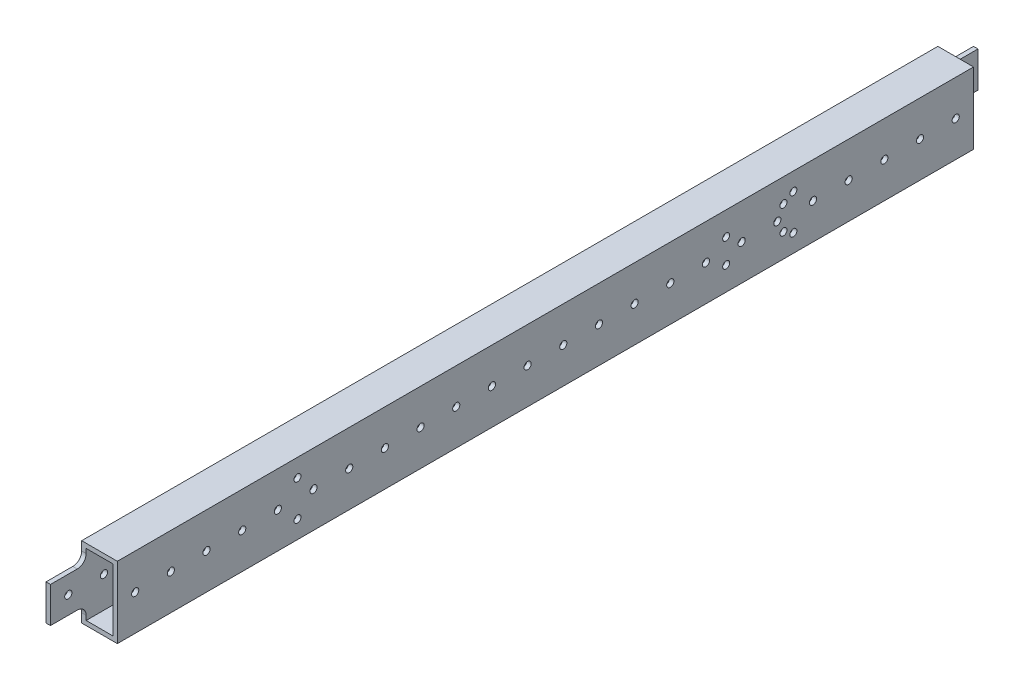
ISO-10303-21;
HEADER;
FILE_DESCRIPTION(('STEP AP214'),'2;1');
FILE_NAME('part.step','',(''),(''),'','','');
FILE_SCHEMA(('AUTOMOTIVE_DESIGN { 1 0 10303 214 1 1 1 1 }'));
ENDSEC;
DATA;
#1=APPLICATION_CONTEXT('core data for automotive mechanical design processes');
#2=APPLICATION_PROTOCOL_DEFINITION('international standard','automotive_design',2000,#1);
#3=PRODUCT_CONTEXT('',#1,'mechanical');
#4=PRODUCT('Part','Part','',(#3));
#5=PRODUCT_RELATED_PRODUCT_CATEGORY('part','',(#4));
#6=PRODUCT_DEFINITION_FORMATION('','',#4);
#7=PRODUCT_DEFINITION_CONTEXT('part definition',#1,'design');
#8=PRODUCT_DEFINITION('design','',#6,#7);
#9=PRODUCT_DEFINITION_SHAPE('','',#8);
#10=(LENGTH_UNIT() NAMED_UNIT(*) SI_UNIT(.MILLI.,.METRE.));
#11=(NAMED_UNIT(*) PLANE_ANGLE_UNIT() SI_UNIT($,.RADIAN.));
#12=(NAMED_UNIT(*) SI_UNIT($,.STERADIAN.) SOLID_ANGLE_UNIT());
#13=UNCERTAINTY_MEASURE_WITH_UNIT(LENGTH_MEASURE(1.E-05),#10,'distance_accuracy_value','');
#14=(GEOMETRIC_REPRESENTATION_CONTEXT(3) GLOBAL_UNCERTAINTY_ASSIGNED_CONTEXT((#13)) GLOBAL_UNIT_ASSIGNED_CONTEXT((#10,
#11,#12)) REPRESENTATION_CONTEXT('',''));
#15=CARTESIAN_POINT('',(0.,0.,0.));
#16=DIRECTION('',(0.,0.,1.));
#17=DIRECTION('',(1.,0.,0.));
#18=AXIS2_PLACEMENT_3D('',#15,#16,#17);
#19=CARTESIAN_POINT('',(0.,0.,660.4));
#20=DIRECTION('',(0.,0.,-1.));
#21=DIRECTION('',(-1.,0.,0.));
#22=AXIS2_PLACEMENT_3D('',#19,#20,#21);
#23=PLANE('',#22);
#24=DIRECTION('',(0.,-1.,0.));
#25=VECTOR('',#24,1.);
#26=CARTESIAN_POINT('',(3.175,3.175,660.4));
#27=LINE('',#26,#25);
#28=CARTESIAN_POINT('',(3.175,38.1,660.4));
#29=VERTEX_POINT('',#28);
#30=CARTESIAN_POINT('',(3.175,12.7,660.4));
#31=VERTEX_POINT('',#30);
#32=EDGE_CURVE('E561',#29,#31,#27,.T.);
#33=ORIENTED_EDGE('',*,*,#32,.F.);
#34=DIRECTION('',(1.,0.,0.));
#35=VECTOR('',#34,1.);
#36=CARTESIAN_POINT('',(0.,38.1,660.4));
#37=LINE('',#36,#35);
#38=CARTESIAN_POINT('',(0.,38.1,660.4));
#39=VERTEX_POINT('',#38);
#40=EDGE_CURVE('E188',#39,#29,#37,.T.);
#41=ORIENTED_EDGE('',*,*,#40,.F.);
#42=DIRECTION('',(0.,-1.,0.));
#43=VECTOR('',#42,1.);
#44=CARTESIAN_POINT('',(0.,0.,660.4));
#45=LINE('',#44,#43);
#46=CARTESIAN_POINT('',(0.,12.7,660.4));
#47=VERTEX_POINT('',#46);
#48=EDGE_CURVE('E577',#39,#47,#45,.T.);
#49=ORIENTED_EDGE('',*,*,#48,.T.);
#50=DIRECTION('',(1.,0.,0.));
#51=VECTOR('',#50,1.);
#52=CARTESIAN_POINT('',(0.,12.7,660.4));
#53=LINE('',#52,#51);
#54=EDGE_CURVE('E237',#47,#31,#53,.T.);
#55=ORIENTED_EDGE('',*,*,#54,.T.);
#56=EDGE_LOOP('',(#33,#41,#49,#55));
#57=FACE_BOUND('',#56,.T.);
#58=ADVANCED_FACE('F40',(#57),#23,.F.);
#59=CARTESIAN_POINT('',(0.,0.,0.));
#60=DIRECTION('',(0.,0.,-1.));
#61=DIRECTION('',(-1.,0.,0.));
#62=AXIS2_PLACEMENT_3D('',#59,#60,#61);
#63=PLANE('',#62);
#64=DIRECTION('',(1.,0.,0.));
#65=VECTOR('',#64,1.);
#66=CARTESIAN_POINT('',(0.,12.7,0.));
#67=LINE('',#66,#65);
#68=CARTESIAN_POINT('',(0.,12.7,0.));
#69=VERTEX_POINT('',#68);
#70=CARTESIAN_POINT('',(3.175,12.7,0.));
#71=VERTEX_POINT('',#70);
#72=EDGE_CURVE('E261',#69,#71,#67,.T.);
#73=ORIENTED_EDGE('',*,*,#72,.F.);
#74=DIRECTION('',(0.,-1.,0.));
#75=VECTOR('',#74,1.);
#76=CARTESIAN_POINT('',(0.,0.,0.));
#77=LINE('',#76,#75);
#78=CARTESIAN_POINT('',(0.,38.1,0.));
#79=VERTEX_POINT('',#78);
#80=EDGE_CURVE('E576',#79,#69,#77,.T.);
#81=ORIENTED_EDGE('',*,*,#80,.F.);
#82=DIRECTION('',(1.,0.,0.));
#83=VECTOR('',#82,1.);
#84=CARTESIAN_POINT('',(0.,38.1,0.));
#85=LINE('',#84,#83);
#86=CARTESIAN_POINT('',(3.175,38.1,0.));
#87=VERTEX_POINT('',#86);
#88=EDGE_CURVE('E280',#79,#87,#85,.T.);
#89=ORIENTED_EDGE('',*,*,#88,.T.);
#90=DIRECTION('',(0.,-1.,0.));
#91=VECTOR('',#90,1.);
#92=CARTESIAN_POINT('',(3.175,3.175,0.));
#93=LINE('',#92,#91);
#94=EDGE_CURVE('E560',#87,#71,#93,.T.);
#95=ORIENTED_EDGE('',*,*,#94,.T.);
#96=EDGE_LOOP('',(#73,#81,#89,#95));
#97=FACE_BOUND('',#96,.T.);
#98=ADVANCED_FACE('F690',(#97),#63,.T.);
#99=CARTESIAN_POINT('',(0.,0.,660.4));
#100=DIRECTION('',(1.,0.,0.));
#101=DIRECTION('',(0.,0.,-1.));
#102=AXIS2_PLACEMENT_3D('',#99,#100,#101);
#103=PLANE('',#102);
#104=CARTESIAN_POINT('',(0.,16.7894,201.516099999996));
#105=DIRECTION('',(-1.,0.,0.));
#106=DIRECTION('',(0.,0.,1.));
#107=AXIS2_PLACEMENT_3D('',#104,#105,#106);
#108=CIRCLE('',#107,2.01930000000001);
#109=CARTESIAN_POINT('',(0.,16.7894,203.535399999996));
#110=VERTEX_POINT('',#109);
#111=EDGE_CURVE('E1223',#110,#110,#108,.T.);
#112=ORIENTED_EDGE('',*,*,#111,.F.);
#113=EDGE_LOOP('',(#112));
#114=FACE_BOUND('',#113,.T.);
#115=CARTESIAN_POINT('',(0.,34.0106,201.516099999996));
#116=DIRECTION('',(-1.,0.,0.));
#117=DIRECTION('',(0.,0.,1.));
#118=AXIS2_PLACEMENT_3D('',#115,#116,#117);
#119=CIRCLE('',#118,2.01930000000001);
#120=CARTESIAN_POINT('',(0.,34.0106,203.535399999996));
#121=VERTEX_POINT('',#120);
#122=EDGE_CURVE('E1231',#121,#121,#119,.T.);
#123=ORIENTED_EDGE('',*,*,#122,.F.);
#124=EDGE_LOOP('',(#123));
#125=FACE_BOUND('',#124,.T.);
#126=CARTESIAN_POINT('',(0.,34.0106,160.723699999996));
#127=DIRECTION('',(-1.,0.,0.));
#128=DIRECTION('',(0.,0.,1.));
#129=AXIS2_PLACEMENT_3D('',#126,#127,#128);
#130=CIRCLE('',#129,2.01930000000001);
#131=CARTESIAN_POINT('',(0.,34.0106,162.742999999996));
#132=VERTEX_POINT('',#131);
#133=EDGE_CURVE('E1237',#132,#132,#130,.T.);
#134=ORIENTED_EDGE('',*,*,#133,.F.);
#135=EDGE_LOOP('',(#134));
#136=FACE_BOUND('',#135,.T.);
#137=CARTESIAN_POINT('',(0.,16.7894,160.723699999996));
#138=DIRECTION('',(-1.,0.,0.));
#139=DIRECTION('',(0.,0.,1.));
#140=AXIS2_PLACEMENT_3D('',#137,#138,#139);
#141=CIRCLE('',#140,2.01930000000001);
#142=CARTESIAN_POINT('',(0.,16.7894,162.742999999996));
#143=VERTEX_POINT('',#142);
#144=EDGE_CURVE('E1243',#143,#143,#141,.T.);
#145=ORIENTED_EDGE('',*,*,#144,.F.);
#146=EDGE_LOOP('',(#145));
#147=FACE_BOUND('',#146,.T.);
#148=CARTESIAN_POINT('',(0.,12.7,153.662499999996));
#149=DIRECTION('',(-1.,0.,0.));
#150=DIRECTION('',(0.,0.,-1.));
#151=AXIS2_PLACEMENT_3D('',#148,#149,#150);
#152=CIRCLE('',#151,2.48919999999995);
#153=CARTESIAN_POINT('',(0.,12.7,151.173299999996));
#154=VERTEX_POINT('',#153);
#155=EDGE_CURVE('E1249',#154,#154,#152,.T.);
#156=ORIENTED_EDGE('',*,*,#155,.F.);
#157=EDGE_LOOP('',(#156));
#158=FACE_BOUND('',#157,.T.);
#159=CARTESIAN_POINT('',(0.,38.1,153.662499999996));
#160=DIRECTION('',(-1.,0.,0.));
#161=DIRECTION('',(0.,0.,-1.));
#162=AXIS2_PLACEMENT_3D('',#159,#160,#161);
#163=CIRCLE('',#162,2.48919999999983);
#164=CARTESIAN_POINT('',(0.,38.1,151.173299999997));
#165=VERTEX_POINT('',#164);
#166=EDGE_CURVE('E664',#165,#165,#163,.T.);
#167=ORIENTED_EDGE('',*,*,#166,.F.);
#168=EDGE_LOOP('',(#167));
#169=FACE_BOUND('',#168,.T.);
#170=CARTESIAN_POINT('',(0.,38.1,506.737500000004));
#171=DIRECTION('',(-1.,0.,0.));
#172=DIRECTION('',(0.,0.,1.));
#173=AXIS2_PLACEMENT_3D('',#170,#171,#172);
#174=CIRCLE('',#173,2.48919999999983);
#175=CARTESIAN_POINT('',(0.,38.1,509.226700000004));
#176=VERTEX_POINT('',#175);
#177=EDGE_CURVE('E661',#176,#176,#174,.T.);
#178=ORIENTED_EDGE('',*,*,#177,.F.);
#179=EDGE_LOOP('',(#178));
#180=FACE_BOUND('',#179,.T.);
#181=CARTESIAN_POINT('',(0.,12.7,506.737500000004));
#182=DIRECTION('',(-1.,0.,0.));
#183=DIRECTION('',(0.,0.,1.));
#184=AXIS2_PLACEMENT_3D('',#181,#182,#183);
#185=CIRCLE('',#184,2.48919999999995);
#186=CARTESIAN_POINT('',(0.,12.7,509.226700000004));
#187=VERTEX_POINT('',#186);
#188=EDGE_CURVE('E680',#187,#187,#185,.T.);
#189=ORIENTED_EDGE('',*,*,#188,.F.);
#190=EDGE_LOOP('',(#189));
#191=FACE_BOUND('',#190,.T.);
#192=CARTESIAN_POINT('',(0.,25.4,38.1));
#193=DIRECTION('',(-1.,0.,0.));
#194=DIRECTION('',(0.,0.,1.));
#195=AXIS2_PLACEMENT_3D('',#192,#193,#194);
#196=CIRCLE('',#195,2.55269999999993);
#197=CARTESIAN_POINT('',(0.,25.4,40.6527));
#198=VERTEX_POINT('',#197);
#199=EDGE_CURVE('E283',#198,#198,#196,.T.);
#200=ORIENTED_EDGE('',*,*,#199,.F.);
#201=EDGE_LOOP('',(#200));
#202=FACE_BOUND('',#201,.T.);
#203=CARTESIAN_POINT('',(0.,25.4,63.5));
#204=DIRECTION('',(-1.,0.,0.));
#205=DIRECTION('',(0.,0.,1.));
#206=AXIS2_PLACEMENT_3D('',#203,#204,#205);
#207=CIRCLE('',#206,2.55269999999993);
#208=CARTESIAN_POINT('',(0.,25.4,66.0526999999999));
#209=VERTEX_POINT('',#208);
#210=EDGE_CURVE('E297',#209,#209,#207,.T.);
#211=ORIENTED_EDGE('',*,*,#210,.F.);
#212=EDGE_LOOP('',(#211));
#213=FACE_BOUND('',#212,.T.);
#214=CARTESIAN_POINT('',(0.,25.4,88.9));
#215=DIRECTION('',(-1.,0.,0.));
#216=DIRECTION('',(0.,0.,1.));
#217=AXIS2_PLACEMENT_3D('',#214,#215,#216);
#218=CIRCLE('',#217,2.55269999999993);
#219=CARTESIAN_POINT('',(0.,25.4,91.4526999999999));
#220=VERTEX_POINT('',#219);
#221=EDGE_CURVE('E307',#220,#220,#218,.T.);
#222=ORIENTED_EDGE('',*,*,#221,.F.);
#223=EDGE_LOOP('',(#222));
#224=FACE_BOUND('',#223,.T.);
#225=CARTESIAN_POINT('',(0.,25.4,114.3));
#226=DIRECTION('',(-1.,0.,0.));
#227=DIRECTION('',(0.,0.,1.));
#228=AXIS2_PLACEMENT_3D('',#225,#226,#227);
#229=CIRCLE('',#228,2.55269999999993);
#230=CARTESIAN_POINT('',(0.,25.4,116.8527));
#231=VERTEX_POINT('',#230);
#232=EDGE_CURVE('E319',#231,#231,#229,.T.);
#233=ORIENTED_EDGE('',*,*,#232,.F.);
#234=EDGE_LOOP('',(#233));
#235=FACE_BOUND('',#234,.T.);
#236=CARTESIAN_POINT('',(0.,25.4,139.7));
#237=DIRECTION('',(-1.,0.,0.));
#238=DIRECTION('',(0.,0.,1.));
#239=AXIS2_PLACEMENT_3D('',#236,#237,#238);
#240=CIRCLE('',#239,2.55269999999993);
#241=CARTESIAN_POINT('',(0.,25.4,142.2527));
#242=VERTEX_POINT('',#241);
#243=EDGE_CURVE('E329',#242,#242,#240,.T.);
#244=ORIENTED_EDGE('',*,*,#243,.F.);
#245=EDGE_LOOP('',(#244));
#246=FACE_BOUND('',#245,.T.);
#247=CARTESIAN_POINT('',(0.,25.4,165.1));
#248=DIRECTION('',(-1.,0.,0.));
#249=DIRECTION('',(0.,0.,1.));
#250=AXIS2_PLACEMENT_3D('',#247,#248,#249);
#251=CIRCLE('',#250,2.55269999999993);
#252=CARTESIAN_POINT('',(0.,25.4,167.6527));
#253=VERTEX_POINT('',#252);
#254=EDGE_CURVE('E339',#253,#253,#251,.T.);
#255=ORIENTED_EDGE('',*,*,#254,.F.);
#256=EDGE_LOOP('',(#255));
#257=FACE_BOUND('',#256,.T.);
#258=CARTESIAN_POINT('',(0.,25.4,190.5));
#259=DIRECTION('',(-1.,0.,0.));
#260=DIRECTION('',(0.,0.,1.));
#261=AXIS2_PLACEMENT_3D('',#258,#259,#260);
#262=CIRCLE('',#261,2.55269999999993);
#263=CARTESIAN_POINT('',(0.,25.4,193.0527));
#264=VERTEX_POINT('',#263);
#265=EDGE_CURVE('E349',#264,#264,#262,.T.);
#266=ORIENTED_EDGE('',*,*,#265,.F.);
#267=EDGE_LOOP('',(#266));
#268=FACE_BOUND('',#267,.T.);
#269=CARTESIAN_POINT('',(0.,25.4,215.9));
#270=DIRECTION('',(-1.,0.,0.));
#271=DIRECTION('',(0.,0.,1.));
#272=AXIS2_PLACEMENT_3D('',#269,#270,#271);
#273=CIRCLE('',#272,2.55269999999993);
#274=CARTESIAN_POINT('',(0.,25.4,218.4527));
#275=VERTEX_POINT('',#274);
#276=EDGE_CURVE('E359',#275,#275,#273,.T.);
#277=ORIENTED_EDGE('',*,*,#276,.F.);
#278=EDGE_LOOP('',(#277));
#279=FACE_BOUND('',#278,.T.);
#280=CARTESIAN_POINT('',(0.,25.4,241.3));
#281=DIRECTION('',(-1.,0.,0.));
#282=DIRECTION('',(0.,0.,1.));
#283=AXIS2_PLACEMENT_3D('',#280,#281,#282);
#284=CIRCLE('',#283,2.55269999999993);
#285=CARTESIAN_POINT('',(0.,25.4,243.8527));
#286=VERTEX_POINT('',#285);
#287=EDGE_CURVE('E369',#286,#286,#284,.T.);
#288=ORIENTED_EDGE('',*,*,#287,.F.);
#289=EDGE_LOOP('',(#288));
#290=FACE_BOUND('',#289,.T.);
#291=CARTESIAN_POINT('',(0.,25.4,266.7));
#292=DIRECTION('',(-1.,0.,0.));
#293=DIRECTION('',(0.,0.,1.));
#294=AXIS2_PLACEMENT_3D('',#291,#292,#293);
#295=CIRCLE('',#294,2.55269999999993);
#296=CARTESIAN_POINT('',(0.,25.4,269.2527));
#297=VERTEX_POINT('',#296);
#298=EDGE_CURVE('E379',#297,#297,#295,.T.);
#299=ORIENTED_EDGE('',*,*,#298,.F.);
#300=EDGE_LOOP('',(#299));
#301=FACE_BOUND('',#300,.T.);
#302=CARTESIAN_POINT('',(0.,25.4,292.1));
#303=DIRECTION('',(-1.,0.,0.));
#304=DIRECTION('',(0.,0.,1.));
#305=AXIS2_PLACEMENT_3D('',#302,#303,#304);
#306=CIRCLE('',#305,2.55269999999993);
#307=CARTESIAN_POINT('',(0.,25.4,294.6527));
#308=VERTEX_POINT('',#307);
#309=EDGE_CURVE('E389',#308,#308,#306,.T.);
#310=ORIENTED_EDGE('',*,*,#309,.F.);
#311=EDGE_LOOP('',(#310));
#312=FACE_BOUND('',#311,.T.);
#313=CARTESIAN_POINT('',(0.,25.4,317.5));
#314=DIRECTION('',(-1.,0.,0.));
#315=DIRECTION('',(0.,0.,1.));
#316=AXIS2_PLACEMENT_3D('',#313,#314,#315);
#317=CIRCLE('',#316,2.55269999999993);
#318=CARTESIAN_POINT('',(0.,25.4,320.0527));
#319=VERTEX_POINT('',#318);
#320=EDGE_CURVE('E399',#319,#319,#317,.T.);
#321=ORIENTED_EDGE('',*,*,#320,.F.);
#322=EDGE_LOOP('',(#321));
#323=FACE_BOUND('',#322,.T.);
#324=CARTESIAN_POINT('',(0.,25.4,342.9));
#325=DIRECTION('',(-1.,0.,0.));
#326=DIRECTION('',(0.,0.,1.));
#327=AXIS2_PLACEMENT_3D('',#324,#325,#326);
#328=CIRCLE('',#327,2.55269999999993);
#329=CARTESIAN_POINT('',(0.,25.4,345.4527));
#330=VERTEX_POINT('',#329);
#331=EDGE_CURVE('E409',#330,#330,#328,.T.);
#332=ORIENTED_EDGE('',*,*,#331,.F.);
#333=EDGE_LOOP('',(#332));
#334=FACE_BOUND('',#333,.T.);
#335=CARTESIAN_POINT('',(0.,25.4,368.3));
#336=DIRECTION('',(-1.,0.,0.));
#337=DIRECTION('',(0.,0.,1.));
#338=AXIS2_PLACEMENT_3D('',#335,#336,#337);
#339=CIRCLE('',#338,2.55269999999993);
#340=CARTESIAN_POINT('',(0.,25.4,370.8527));
#341=VERTEX_POINT('',#340);
#342=EDGE_CURVE('E419',#341,#341,#339,.T.);
#343=ORIENTED_EDGE('',*,*,#342,.F.);
#344=EDGE_LOOP('',(#343));
#345=FACE_BOUND('',#344,.T.);
#346=CARTESIAN_POINT('',(0.,25.4,393.7));
#347=DIRECTION('',(-1.,0.,0.));
#348=DIRECTION('',(0.,0.,1.));
#349=AXIS2_PLACEMENT_3D('',#346,#347,#348);
#350=CIRCLE('',#349,2.55269999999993);
#351=CARTESIAN_POINT('',(0.,25.4,396.2527));
#352=VERTEX_POINT('',#351);
#353=EDGE_CURVE('E429',#352,#352,#350,.T.);
#354=ORIENTED_EDGE('',*,*,#353,.F.);
#355=EDGE_LOOP('',(#354));
#356=FACE_BOUND('',#355,.T.);
#357=CARTESIAN_POINT('',(0.,25.4,419.1));
#358=DIRECTION('',(-1.,0.,0.));
#359=DIRECTION('',(0.,0.,1.));
#360=AXIS2_PLACEMENT_3D('',#357,#358,#359);
#361=CIRCLE('',#360,2.55269999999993);
#362=CARTESIAN_POINT('',(0.,25.4,421.6527));
#363=VERTEX_POINT('',#362);
#364=EDGE_CURVE('E439',#363,#363,#361,.T.);
#365=ORIENTED_EDGE('',*,*,#364,.F.);
#366=EDGE_LOOP('',(#365));
#367=FACE_BOUND('',#366,.T.);
#368=CARTESIAN_POINT('',(0.,25.4,444.5));
#369=DIRECTION('',(-1.,0.,0.));
#370=DIRECTION('',(0.,0.,1.));
#371=AXIS2_PLACEMENT_3D('',#368,#369,#370);
#372=CIRCLE('',#371,2.55269999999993);
#373=CARTESIAN_POINT('',(0.,25.4,447.0527));
#374=VERTEX_POINT('',#373);
#375=EDGE_CURVE('E449',#374,#374,#372,.T.);
#376=ORIENTED_EDGE('',*,*,#375,.F.);
#377=EDGE_LOOP('',(#376));
#378=FACE_BOUND('',#377,.T.);
#379=CARTESIAN_POINT('',(0.,25.4,469.9));
#380=DIRECTION('',(-1.,0.,0.));
#381=DIRECTION('',(0.,0.,1.));
#382=AXIS2_PLACEMENT_3D('',#379,#380,#381);
#383=CIRCLE('',#382,2.55269999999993);
#384=CARTESIAN_POINT('',(0.,25.4,472.4527));
#385=VERTEX_POINT('',#384);
#386=EDGE_CURVE('E459',#385,#385,#383,.T.);
#387=ORIENTED_EDGE('',*,*,#386,.F.);
#388=EDGE_LOOP('',(#387));
#389=FACE_BOUND('',#388,.T.);
#390=CARTESIAN_POINT('',(0.,25.4,495.3));
#391=DIRECTION('',(-1.,0.,0.));
#392=DIRECTION('',(0.,0.,1.));
#393=AXIS2_PLACEMENT_3D('',#390,#391,#392);
#394=CIRCLE('',#393,2.55269999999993);
#395=CARTESIAN_POINT('',(0.,25.4,497.8527));
#396=VERTEX_POINT('',#395);
#397=EDGE_CURVE('E469',#396,#396,#394,.T.);
#398=ORIENTED_EDGE('',*,*,#397,.F.);
#399=EDGE_LOOP('',(#398));
#400=FACE_BOUND('',#399,.T.);
#401=CARTESIAN_POINT('',(0.,25.4,520.7));
#402=DIRECTION('',(-1.,0.,0.));
#403=DIRECTION('',(0.,0.,1.));
#404=AXIS2_PLACEMENT_3D('',#401,#402,#403);
#405=CIRCLE('',#404,2.55269999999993);
#406=CARTESIAN_POINT('',(0.,25.4,523.2527));
#407=VERTEX_POINT('',#406);
#408=EDGE_CURVE('E479',#407,#407,#405,.T.);
#409=ORIENTED_EDGE('',*,*,#408,.F.);
#410=EDGE_LOOP('',(#409));
#411=FACE_BOUND('',#410,.T.);
#412=CARTESIAN_POINT('',(0.,25.4,546.1));
#413=DIRECTION('',(-1.,0.,0.));
#414=DIRECTION('',(0.,0.,1.));
#415=AXIS2_PLACEMENT_3D('',#412,#413,#414);
#416=CIRCLE('',#415,2.55269999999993);
#417=CARTESIAN_POINT('',(0.,25.4,548.6527));
#418=VERTEX_POINT('',#417);
#419=EDGE_CURVE('E489',#418,#418,#416,.T.);
#420=ORIENTED_EDGE('',*,*,#419,.F.);
#421=EDGE_LOOP('',(#420));
#422=FACE_BOUND('',#421,.T.);
#423=CARTESIAN_POINT('',(0.,25.4,571.5));
#424=DIRECTION('',(-1.,0.,0.));
#425=DIRECTION('',(0.,0.,1.));
#426=AXIS2_PLACEMENT_3D('',#423,#424,#425);
#427=CIRCLE('',#426,2.55269999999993);
#428=CARTESIAN_POINT('',(0.,25.4,574.0527));
#429=VERTEX_POINT('',#428);
#430=EDGE_CURVE('E499',#429,#429,#427,.T.);
#431=ORIENTED_EDGE('',*,*,#430,.F.);
#432=EDGE_LOOP('',(#431));
#433=FACE_BOUND('',#432,.T.);
#434=CARTESIAN_POINT('',(0.,25.4,596.9));
#435=DIRECTION('',(-1.,0.,0.));
#436=DIRECTION('',(0.,0.,1.));
#437=AXIS2_PLACEMENT_3D('',#434,#435,#436);
#438=CIRCLE('',#437,2.55269999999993);
#439=CARTESIAN_POINT('',(0.,25.4,599.4527));
#440=VERTEX_POINT('',#439);
#441=EDGE_CURVE('E509',#440,#440,#438,.T.);
#442=ORIENTED_EDGE('',*,*,#441,.F.);
#443=EDGE_LOOP('',(#442));
#444=FACE_BOUND('',#443,.T.);
#445=CARTESIAN_POINT('',(0.,25.4,622.3));
#446=DIRECTION('',(-1.,0.,0.));
#447=DIRECTION('',(0.,0.,1.));
#448=AXIS2_PLACEMENT_3D('',#445,#446,#447);
#449=CIRCLE('',#448,2.55269999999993);
#450=CARTESIAN_POINT('',(0.,25.4,624.8527));
#451=VERTEX_POINT('',#450);
#452=EDGE_CURVE('E519',#451,#451,#449,.T.);
#453=ORIENTED_EDGE('',*,*,#452,.F.);
#454=EDGE_LOOP('',(#453));
#455=FACE_BOUND('',#454,.T.);
#456=CARTESIAN_POINT('',(0.,25.4,12.7));
#457=DIRECTION('',(-1.,0.,0.));
#458=DIRECTION('',(0.,0.,1.));
#459=AXIS2_PLACEMENT_3D('',#456,#457,#458);
#460=CIRCLE('',#459,2.55269999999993);
#461=CARTESIAN_POINT('',(0.,25.4,15.2527));
#462=VERTEX_POINT('',#461);
#463=EDGE_CURVE('E529',#462,#462,#460,.T.);
#464=ORIENTED_EDGE('',*,*,#463,.F.);
#465=EDGE_LOOP('',(#464));
#466=FACE_BOUND('',#465,.T.);
#467=CARTESIAN_POINT('',(0.,25.4,647.7));
#468=DIRECTION('',(-1.,0.,0.));
#469=DIRECTION('',(0.,0.,1.));
#470=AXIS2_PLACEMENT_3D('',#467,#468,#469);
#471=CIRCLE('',#470,2.55269999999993);
#472=CARTESIAN_POINT('',(0.,25.4,650.2527));
#473=VERTEX_POINT('',#472);
#474=EDGE_CURVE('E533',#473,#473,#471,.T.);
#475=ORIENTED_EDGE('',*,*,#474,.F.);
#476=EDGE_LOOP('',(#475));
#477=FACE_BOUND('',#476,.T.);
#478=ORIENTED_EDGE('',*,*,#48,.F.);
#479=DIRECTION('',(0.,0.,-1.));
#480=VECTOR('',#479,1.);
#481=CARTESIAN_POINT('',(0.,38.1,660.4));
#482=LINE('',#481,#480);
#483=CARTESIAN_POINT('',(0.,38.1,641.35));
#484=VERTEX_POINT('',#483);
#485=EDGE_CURVE('E189',#39,#484,#482,.T.);
#486=ORIENTED_EDGE('',*,*,#485,.T.);
#487=CARTESIAN_POINT('',(0.,44.45,641.35));
#488=DIRECTION('',(1.,0.,0.));
#489=DIRECTION('',(0.,0.,-1.));
#490=AXIS2_PLACEMENT_3D('',#487,#488,#489);
#491=CIRCLE('',#490,6.35000000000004);
#492=CARTESIAN_POINT('',(0.,44.45,635.));
#493=VERTEX_POINT('',#492);
#494=EDGE_CURVE('E184',#484,#493,#491,.T.);
#495=ORIENTED_EDGE('',*,*,#494,.T.);
#496=DIRECTION('',(0.,1.,0.));
#497=VECTOR('',#496,1.);
#498=CARTESIAN_POINT('',(0.,50.8,635.));
#499=LINE('',#498,#497);
#500=CARTESIAN_POINT('',(0.,50.8,635.));
#501=VERTEX_POINT('',#500);
#502=EDGE_CURVE('E192',#493,#501,#499,.T.);
#503=ORIENTED_EDGE('',*,*,#502,.T.);
#504=DIRECTION('',(0.,0.,-1.));
#505=VECTOR('',#504,1.);
#506=CARTESIAN_POINT('',(0.,50.8,660.4));
#507=LINE('',#506,#505);
#508=CARTESIAN_POINT('',(0.,50.8,25.4));
#509=VERTEX_POINT('',#508);
#510=EDGE_CURVE('E579',#501,#509,#507,.T.);
#511=ORIENTED_EDGE('',*,*,#510,.T.);
#512=DIRECTION('',(0.,-1.,0.));
#513=VECTOR('',#512,1.);
#514=CARTESIAN_POINT('',(0.,50.8,25.4));
#515=LINE('',#514,#513);
#516=CARTESIAN_POINT('',(0.,44.45,25.4));
#517=VERTEX_POINT('',#516);
#518=EDGE_CURVE('E264',#509,#517,#515,.T.);
#519=ORIENTED_EDGE('',*,*,#518,.T.);
#520=CARTESIAN_POINT('',(0.,44.45,19.05));
#521=DIRECTION('',(1.,0.,0.));
#522=DIRECTION('',(0.,0.,1.));
#523=AXIS2_PLACEMENT_3D('',#520,#521,#522);
#524=CIRCLE('',#523,6.35);
#525=CARTESIAN_POINT('',(0.,38.1,19.05));
#526=VERTEX_POINT('',#525);
#527=EDGE_CURVE('E267',#517,#526,#524,.T.);
#528=ORIENTED_EDGE('',*,*,#527,.T.);
#529=DIRECTION('',(0.,0.,-1.));
#530=VECTOR('',#529,1.);
#531=CARTESIAN_POINT('',(0.,38.1,0.));
#532=LINE('',#531,#530);
#533=EDGE_CURVE('E271',#526,#79,#532,.T.);
#534=ORIENTED_EDGE('',*,*,#533,.T.);
#535=ORIENTED_EDGE('',*,*,#80,.T.);
#536=DIRECTION('',(0.,0.,1.));
#537=VECTOR('',#536,1.);
#538=CARTESIAN_POINT('',(0.,12.7,0.));
#539=LINE('',#538,#537);
#540=CARTESIAN_POINT('',(0.,12.7,19.05));
#541=VERTEX_POINT('',#540);
#542=EDGE_CURVE('E248',#69,#541,#539,.T.);
#543=ORIENTED_EDGE('',*,*,#542,.T.);
#544=CARTESIAN_POINT('',(0.,6.35,19.05));
#545=DIRECTION('',(1.,0.,0.));
#546=DIRECTION('',(0.,0.,-1.));
#547=AXIS2_PLACEMENT_3D('',#544,#545,#546);
#548=CIRCLE('',#547,6.35);
#549=CARTESIAN_POINT('',(0.,6.35,25.4));
#550=VERTEX_POINT('',#549);
#551=EDGE_CURVE('E241',#541,#550,#548,.T.);
#552=ORIENTED_EDGE('',*,*,#551,.T.);
#553=DIRECTION('',(0.,-1.,0.));
#554=VECTOR('',#553,1.);
#555=CARTESIAN_POINT('',(0.,0.,25.4));
#556=LINE('',#555,#554);
#557=CARTESIAN_POINT('',(0.,0.,25.4));
#558=VERTEX_POINT('',#557);
#559=EDGE_CURVE('E244',#550,#558,#556,.T.);
#560=ORIENTED_EDGE('',*,*,#559,.T.);
#561=DIRECTION('',(0.,0.,-1.));
#562=VECTOR('',#561,1.);
#563=CARTESIAN_POINT('',(0.,0.,660.4));
#564=LINE('',#563,#562);
#565=CARTESIAN_POINT('',(0.,0.,635.));
#566=VERTEX_POINT('',#565);
#567=EDGE_CURVE('E588',#566,#558,#564,.T.);
#568=ORIENTED_EDGE('',*,*,#567,.F.);
#569=DIRECTION('',(0.,1.,0.));
#570=VECTOR('',#569,1.);
#571=CARTESIAN_POINT('',(0.,0.,635.));
#572=LINE('',#571,#570);
#573=CARTESIAN_POINT('',(0.,6.35,635.));
#574=VERTEX_POINT('',#573);
#575=EDGE_CURVE('E223',#566,#574,#572,.T.);
#576=ORIENTED_EDGE('',*,*,#575,.T.);
#577=CARTESIAN_POINT('',(0.,6.35,641.35));
#578=DIRECTION('',(1.,0.,0.));
#579=DIRECTION('',(0.,0.,1.));
#580=AXIS2_PLACEMENT_3D('',#577,#578,#579);
#581=CIRCLE('',#580,6.35000000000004);
#582=CARTESIAN_POINT('',(0.,12.7,641.35));
#583=VERTEX_POINT('',#582);
#584=EDGE_CURVE('E216',#574,#583,#581,.T.);
#585=ORIENTED_EDGE('',*,*,#584,.T.);
#586=DIRECTION('',(0.,0.,1.));
#587=VECTOR('',#586,1.);
#588=CARTESIAN_POINT('',(0.,12.7,660.4));
#589=LINE('',#588,#587);
#590=EDGE_CURVE('E219',#583,#47,#589,.T.);
#591=ORIENTED_EDGE('',*,*,#590,.T.);
#592=EDGE_LOOP('',(#478,#486,#495,#503,#511,#519,#528,#534,#535,#543,#552,#560,#568,#576,#585,#591));
#593=FACE_BOUND('',#592,.T.);
#594=ADVANCED_FACE('F42',(#114,#125,#136,#147,#158,#169,#180,#191,#202,#213,#224,#235,#246,#257,
#268,#279,#290,#301,#312,#323,#334,#345,#356,#367,#378,#389,#400,#411,#422,#433,#444,#455,#466,
#477,#593),#103,.F.);
#595=CARTESIAN_POINT('',(0.,0.,660.4));
#596=DIRECTION('',(0.,1.,0.));
#597=DIRECTION('',(0.,0.,1.));
#598=AXIS2_PLACEMENT_3D('',#595,#596,#597);
#599=PLANE('',#598);
#600=DIRECTION('',(-1.,0.,0.));
#601=VECTOR('',#600,1.);
#602=CARTESIAN_POINT('',(25.4,0.,635.));
#603=LINE('',#602,#601);
#604=CARTESIAN_POINT('',(25.4,0.,635.));
#605=VERTEX_POINT('',#604);
#606=EDGE_CURVE('E537',#605,#566,#603,.T.);
#607=ORIENTED_EDGE('',*,*,#606,.T.);
#608=ORIENTED_EDGE('',*,*,#567,.T.);
#609=DIRECTION('',(1.,0.,0.));
#610=VECTOR('',#609,1.);
#611=CARTESIAN_POINT('',(25.4,0.,25.4));
#612=LINE('',#611,#610);
#613=CARTESIAN_POINT('',(25.4,0.,25.4));
#614=VERTEX_POINT('',#613);
#615=EDGE_CURVE('E547',#558,#614,#612,.T.);
#616=ORIENTED_EDGE('',*,*,#615,.T.);
#617=DIRECTION('',(0.,0.,-1.));
#618=VECTOR('',#617,1.);
#619=CARTESIAN_POINT('',(25.4,0.,660.4));
#620=LINE('',#619,#618);
#621=EDGE_CURVE('E586',#605,#614,#620,.T.);
#622=ORIENTED_EDGE('',*,*,#621,.F.);
#623=EDGE_LOOP('',(#607,#608,#616,#622));
#624=FACE_BOUND('',#623,.T.);
#625=ADVANCED_FACE('F689',(#624),#599,.F.);
#626=CARTESIAN_POINT('',(25.4,0.,660.4));
#627=DIRECTION('',(-1.,0.,0.));
#628=DIRECTION('',(0.,0.,1.));
#629=AXIS2_PLACEMENT_3D('',#626,#627,#628);
#630=PLANE('',#629);
#631=CARTESIAN_POINT('',(25.4,16.7894,201.516099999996));
#632=DIRECTION('',(1.,0.,0.));
#633=DIRECTION('',(0.,0.,-1.));
#634=AXIS2_PLACEMENT_3D('',#631,#632,#633);
#635=CIRCLE('',#634,2.4892);
#636=CARTESIAN_POINT('',(25.4,16.7894,199.026899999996));
#637=VERTEX_POINT('',#636);
#638=EDGE_CURVE('E1203',#637,#637,#635,.T.);
#639=ORIENTED_EDGE('',*,*,#638,.F.);
#640=EDGE_LOOP('',(#639));
#641=FACE_BOUND('',#640,.T.);
#642=CARTESIAN_POINT('',(25.4,16.7894,160.723699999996));
#643=DIRECTION('',(1.,0.,0.));
#644=DIRECTION('',(0.,0.,-1.));
#645=AXIS2_PLACEMENT_3D('',#642,#643,#644);
#646=CIRCLE('',#645,2.4892);
#647=CARTESIAN_POINT('',(25.4,16.7894,158.234499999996));
#648=VERTEX_POINT('',#647);
#649=EDGE_CURVE('E1205',#648,#648,#646,.T.);
#650=ORIENTED_EDGE('',*,*,#649,.F.);
#651=EDGE_LOOP('',(#650));
#652=FACE_BOUND('',#651,.T.);
#653=CARTESIAN_POINT('',(25.4,34.0106,160.723699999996));
#654=DIRECTION('',(1.,0.,0.));
#655=DIRECTION('',(0.,0.,-1.));
#656=AXIS2_PLACEMENT_3D('',#653,#654,#655);
#657=CIRCLE('',#656,2.4892);
#658=CARTESIAN_POINT('',(25.4,34.0106,158.234499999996));
#659=VERTEX_POINT('',#658);
#660=EDGE_CURVE('E1211',#659,#659,#657,.T.);
#661=ORIENTED_EDGE('',*,*,#660,.F.);
#662=EDGE_LOOP('',(#661));
#663=FACE_BOUND('',#662,.T.);
#664=CARTESIAN_POINT('',(25.4,34.0106,201.516099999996));
#665=DIRECTION('',(1.,0.,0.));
#666=DIRECTION('',(0.,0.,-1.));
#667=AXIS2_PLACEMENT_3D('',#664,#665,#666);
#668=CIRCLE('',#667,2.4892);
#669=CARTESIAN_POINT('',(25.4,34.0106,199.026899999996));
#670=VERTEX_POINT('',#669);
#671=EDGE_CURVE('E1217',#670,#670,#668,.T.);
#672=ORIENTED_EDGE('',*,*,#671,.F.);
#673=EDGE_LOOP('',(#672));
#674=FACE_BOUND('',#673,.T.);
#675=CARTESIAN_POINT('',(25.4,12.7,153.662499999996));
#676=DIRECTION('',(-1.,0.,0.));
#677=DIRECTION('',(0.,0.,-1.));
#678=AXIS2_PLACEMENT_3D('',#675,#676,#677);
#679=CIRCLE('',#678,2.48919999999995);
#680=CARTESIAN_POINT('',(25.4,12.7,151.173299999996));
#681=VERTEX_POINT('',#680);
#682=EDGE_CURVE('E1250',#681,#681,#679,.T.);
#683=ORIENTED_EDGE('',*,*,#682,.T.);
#684=EDGE_LOOP('',(#683));
#685=FACE_BOUND('',#684,.T.);
#686=CARTESIAN_POINT('',(25.4,38.1,153.662499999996));
#687=DIRECTION('',(-1.,0.,0.));
#688=DIRECTION('',(0.,0.,-1.));
#689=AXIS2_PLACEMENT_3D('',#686,#687,#688);
#690=CIRCLE('',#689,2.48919999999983);
#691=CARTESIAN_POINT('',(25.4,38.1,151.173299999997));
#692=VERTEX_POINT('',#691);
#693=EDGE_CURVE('E657',#692,#692,#690,.T.);
#694=ORIENTED_EDGE('',*,*,#693,.T.);
#695=EDGE_LOOP('',(#694));
#696=FACE_BOUND('',#695,.T.);
#697=CARTESIAN_POINT('',(25.4,38.1,506.737500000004));
#698=DIRECTION('',(-1.,0.,0.));
#699=DIRECTION('',(0.,0.,1.));
#700=AXIS2_PLACEMENT_3D('',#697,#698,#699);
#701=CIRCLE('',#700,2.48919999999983);
#702=CARTESIAN_POINT('',(25.4,38.1,509.226700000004));
#703=VERTEX_POINT('',#702);
#704=EDGE_CURVE('E653',#703,#703,#701,.T.);
#705=ORIENTED_EDGE('',*,*,#704,.T.);
#706=EDGE_LOOP('',(#705));
#707=FACE_BOUND('',#706,.T.);
#708=CARTESIAN_POINT('',(25.4,12.7,506.737500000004));
#709=DIRECTION('',(-1.,0.,0.));
#710=DIRECTION('',(0.,0.,1.));
#711=AXIS2_PLACEMENT_3D('',#708,#709,#710);
#712=CIRCLE('',#711,2.48919999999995);
#713=CARTESIAN_POINT('',(25.4,12.7,509.226700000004));
#714=VERTEX_POINT('',#713);
#715=EDGE_CURVE('E649',#714,#714,#712,.T.);
#716=ORIENTED_EDGE('',*,*,#715,.T.);
#717=EDGE_LOOP('',(#716));
#718=FACE_BOUND('',#717,.T.);
#719=CARTESIAN_POINT('',(25.4,25.4,38.1));
#720=DIRECTION('',(-1.,0.,0.));
#721=DIRECTION('',(0.,0.,1.));
#722=AXIS2_PLACEMENT_3D('',#719,#720,#721);
#723=CIRCLE('',#722,2.55269999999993);
#724=CARTESIAN_POINT('',(25.4,25.4,40.6527));
#725=VERTEX_POINT('',#724);
#726=EDGE_CURVE('E288',#725,#725,#723,.T.);
#727=ORIENTED_EDGE('',*,*,#726,.T.);
#728=EDGE_LOOP('',(#727));
#729=FACE_BOUND('',#728,.T.);
#730=CARTESIAN_POINT('',(25.4,25.4,63.5));
#731=DIRECTION('',(-1.,0.,0.));
#732=DIRECTION('',(0.,0.,1.));
#733=AXIS2_PLACEMENT_3D('',#730,#731,#732);
#734=CIRCLE('',#733,2.55269999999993);
#735=CARTESIAN_POINT('',(25.4,25.4,66.0526999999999));
#736=VERTEX_POINT('',#735);
#737=EDGE_CURVE('E298',#736,#736,#734,.T.);
#738=ORIENTED_EDGE('',*,*,#737,.T.);
#739=EDGE_LOOP('',(#738));
#740=FACE_BOUND('',#739,.T.);
#741=CARTESIAN_POINT('',(25.4,25.4,88.9));
#742=DIRECTION('',(-1.,0.,0.));
#743=DIRECTION('',(0.,0.,1.));
#744=AXIS2_PLACEMENT_3D('',#741,#742,#743);
#745=CIRCLE('',#744,2.55269999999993);
#746=CARTESIAN_POINT('',(25.4,25.4,91.4526999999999));
#747=VERTEX_POINT('',#746);
#748=EDGE_CURVE('E308',#747,#747,#745,.T.);
#749=ORIENTED_EDGE('',*,*,#748,.T.);
#750=EDGE_LOOP('',(#749));
#751=FACE_BOUND('',#750,.T.);
#752=CARTESIAN_POINT('',(25.4,25.4,114.3));
#753=DIRECTION('',(-1.,0.,0.));
#754=DIRECTION('',(0.,0.,1.));
#755=AXIS2_PLACEMENT_3D('',#752,#753,#754);
#756=CIRCLE('',#755,2.55269999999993);
#757=CARTESIAN_POINT('',(25.4,25.4,116.8527));
#758=VERTEX_POINT('',#757);
#759=EDGE_CURVE('E320',#758,#758,#756,.T.);
#760=ORIENTED_EDGE('',*,*,#759,.T.);
#761=EDGE_LOOP('',(#760));
#762=FACE_BOUND('',#761,.T.);
#763=CARTESIAN_POINT('',(25.4,25.4,139.7));
#764=DIRECTION('',(-1.,0.,0.));
#765=DIRECTION('',(0.,0.,1.));
#766=AXIS2_PLACEMENT_3D('',#763,#764,#765);
#767=CIRCLE('',#766,2.55269999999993);
#768=CARTESIAN_POINT('',(25.4,25.4,142.2527));
#769=VERTEX_POINT('',#768);
#770=EDGE_CURVE('E330',#769,#769,#767,.T.);
#771=ORIENTED_EDGE('',*,*,#770,.T.);
#772=EDGE_LOOP('',(#771));
#773=FACE_BOUND('',#772,.T.);
#774=CARTESIAN_POINT('',(25.4,25.4,165.1));
#775=DIRECTION('',(-1.,0.,0.));
#776=DIRECTION('',(0.,0.,1.));
#777=AXIS2_PLACEMENT_3D('',#774,#775,#776);
#778=CIRCLE('',#777,2.55269999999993);
#779=CARTESIAN_POINT('',(25.4,25.4,167.6527));
#780=VERTEX_POINT('',#779);
#781=EDGE_CURVE('E340',#780,#780,#778,.T.);
#782=ORIENTED_EDGE('',*,*,#781,.T.);
#783=EDGE_LOOP('',(#782));
#784=FACE_BOUND('',#783,.T.);
#785=CARTESIAN_POINT('',(25.4,25.4,190.5));
#786=DIRECTION('',(-1.,0.,0.));
#787=DIRECTION('',(0.,0.,1.));
#788=AXIS2_PLACEMENT_3D('',#785,#786,#787);
#789=CIRCLE('',#788,2.55269999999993);
#790=CARTESIAN_POINT('',(25.4,25.4,193.0527));
#791=VERTEX_POINT('',#790);
#792=EDGE_CURVE('E350',#791,#791,#789,.T.);
#793=ORIENTED_EDGE('',*,*,#792,.T.);
#794=EDGE_LOOP('',(#793));
#795=FACE_BOUND('',#794,.T.);
#796=CARTESIAN_POINT('',(25.4,25.4,215.9));
#797=DIRECTION('',(-1.,0.,0.));
#798=DIRECTION('',(0.,0.,1.));
#799=AXIS2_PLACEMENT_3D('',#796,#797,#798);
#800=CIRCLE('',#799,2.55269999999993);
#801=CARTESIAN_POINT('',(25.4,25.4,218.4527));
#802=VERTEX_POINT('',#801);
#803=EDGE_CURVE('E360',#802,#802,#800,.T.);
#804=ORIENTED_EDGE('',*,*,#803,.T.);
#805=EDGE_LOOP('',(#804));
#806=FACE_BOUND('',#805,.T.);
#807=CARTESIAN_POINT('',(25.4,25.4,241.3));
#808=DIRECTION('',(-1.,0.,0.));
#809=DIRECTION('',(0.,0.,1.));
#810=AXIS2_PLACEMENT_3D('',#807,#808,#809);
#811=CIRCLE('',#810,2.55269999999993);
#812=CARTESIAN_POINT('',(25.4,25.4,243.8527));
#813=VERTEX_POINT('',#812);
#814=EDGE_CURVE('E370',#813,#813,#811,.T.);
#815=ORIENTED_EDGE('',*,*,#814,.T.);
#816=EDGE_LOOP('',(#815));
#817=FACE_BOUND('',#816,.T.);
#818=CARTESIAN_POINT('',(25.4,25.4,266.7));
#819=DIRECTION('',(-1.,0.,0.));
#820=DIRECTION('',(0.,0.,1.));
#821=AXIS2_PLACEMENT_3D('',#818,#819,#820);
#822=CIRCLE('',#821,2.55269999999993);
#823=CARTESIAN_POINT('',(25.4,25.4,269.2527));
#824=VERTEX_POINT('',#823);
#825=EDGE_CURVE('E380',#824,#824,#822,.T.);
#826=ORIENTED_EDGE('',*,*,#825,.T.);
#827=EDGE_LOOP('',(#826));
#828=FACE_BOUND('',#827,.T.);
#829=CARTESIAN_POINT('',(25.4,25.4,292.1));
#830=DIRECTION('',(-1.,0.,0.));
#831=DIRECTION('',(0.,0.,1.));
#832=AXIS2_PLACEMENT_3D('',#829,#830,#831);
#833=CIRCLE('',#832,2.55269999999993);
#834=CARTESIAN_POINT('',(25.4,25.4,294.6527));
#835=VERTEX_POINT('',#834);
#836=EDGE_CURVE('E390',#835,#835,#833,.T.);
#837=ORIENTED_EDGE('',*,*,#836,.T.);
#838=EDGE_LOOP('',(#837));
#839=FACE_BOUND('',#838,.T.);
#840=CARTESIAN_POINT('',(25.4,25.4,317.5));
#841=DIRECTION('',(-1.,0.,0.));
#842=DIRECTION('',(0.,0.,1.));
#843=AXIS2_PLACEMENT_3D('',#840,#841,#842);
#844=CIRCLE('',#843,2.55269999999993);
#845=CARTESIAN_POINT('',(25.4,25.4,320.0527));
#846=VERTEX_POINT('',#845);
#847=EDGE_CURVE('E400',#846,#846,#844,.T.);
#848=ORIENTED_EDGE('',*,*,#847,.T.);
#849=EDGE_LOOP('',(#848));
#850=FACE_BOUND('',#849,.T.);
#851=CARTESIAN_POINT('',(25.4,25.4,342.9));
#852=DIRECTION('',(-1.,0.,0.));
#853=DIRECTION('',(0.,0.,1.));
#854=AXIS2_PLACEMENT_3D('',#851,#852,#853);
#855=CIRCLE('',#854,2.55269999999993);
#856=CARTESIAN_POINT('',(25.4,25.4,345.4527));
#857=VERTEX_POINT('',#856);
#858=EDGE_CURVE('E410',#857,#857,#855,.T.);
#859=ORIENTED_EDGE('',*,*,#858,.T.);
#860=EDGE_LOOP('',(#859));
#861=FACE_BOUND('',#860,.T.);
#862=CARTESIAN_POINT('',(25.4,25.4,368.3));
#863=DIRECTION('',(-1.,0.,0.));
#864=DIRECTION('',(0.,0.,1.));
#865=AXIS2_PLACEMENT_3D('',#862,#863,#864);
#866=CIRCLE('',#865,2.55269999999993);
#867=CARTESIAN_POINT('',(25.4,25.4,370.8527));
#868=VERTEX_POINT('',#867);
#869=EDGE_CURVE('E420',#868,#868,#866,.T.);
#870=ORIENTED_EDGE('',*,*,#869,.T.);
#871=EDGE_LOOP('',(#870));
#872=FACE_BOUND('',#871,.T.);
#873=CARTESIAN_POINT('',(25.4,25.4,393.7));
#874=DIRECTION('',(-1.,0.,0.));
#875=DIRECTION('',(0.,0.,1.));
#876=AXIS2_PLACEMENT_3D('',#873,#874,#875);
#877=CIRCLE('',#876,2.55269999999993);
#878=CARTESIAN_POINT('',(25.4,25.4,396.2527));
#879=VERTEX_POINT('',#878);
#880=EDGE_CURVE('E430',#879,#879,#877,.T.);
#881=ORIENTED_EDGE('',*,*,#880,.T.);
#882=EDGE_LOOP('',(#881));
#883=FACE_BOUND('',#882,.T.);
#884=CARTESIAN_POINT('',(25.4,25.4,419.1));
#885=DIRECTION('',(-1.,0.,0.));
#886=DIRECTION('',(0.,0.,1.));
#887=AXIS2_PLACEMENT_3D('',#884,#885,#886);
#888=CIRCLE('',#887,2.55269999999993);
#889=CARTESIAN_POINT('',(25.4,25.4,421.6527));
#890=VERTEX_POINT('',#889);
#891=EDGE_CURVE('E440',#890,#890,#888,.T.);
#892=ORIENTED_EDGE('',*,*,#891,.T.);
#893=EDGE_LOOP('',(#892));
#894=FACE_BOUND('',#893,.T.);
#895=CARTESIAN_POINT('',(25.4,25.4,444.5));
#896=DIRECTION('',(-1.,0.,0.));
#897=DIRECTION('',(0.,0.,1.));
#898=AXIS2_PLACEMENT_3D('',#895,#896,#897);
#899=CIRCLE('',#898,2.55269999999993);
#900=CARTESIAN_POINT('',(25.4,25.4,447.0527));
#901=VERTEX_POINT('',#900);
#902=EDGE_CURVE('E450',#901,#901,#899,.T.);
#903=ORIENTED_EDGE('',*,*,#902,.T.);
#904=EDGE_LOOP('',(#903));
#905=FACE_BOUND('',#904,.T.);
#906=CARTESIAN_POINT('',(25.4,25.4,469.9));
#907=DIRECTION('',(-1.,0.,0.));
#908=DIRECTION('',(0.,0.,1.));
#909=AXIS2_PLACEMENT_3D('',#906,#907,#908);
#910=CIRCLE('',#909,2.55269999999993);
#911=CARTESIAN_POINT('',(25.4,25.4,472.4527));
#912=VERTEX_POINT('',#911);
#913=EDGE_CURVE('E460',#912,#912,#910,.T.);
#914=ORIENTED_EDGE('',*,*,#913,.T.);
#915=EDGE_LOOP('',(#914));
#916=FACE_BOUND('',#915,.T.);
#917=CARTESIAN_POINT('',(25.4,25.4,495.3));
#918=DIRECTION('',(-1.,0.,0.));
#919=DIRECTION('',(0.,0.,1.));
#920=AXIS2_PLACEMENT_3D('',#917,#918,#919);
#921=CIRCLE('',#920,2.55269999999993);
#922=CARTESIAN_POINT('',(25.4,25.4,497.8527));
#923=VERTEX_POINT('',#922);
#924=EDGE_CURVE('E470',#923,#923,#921,.T.);
#925=ORIENTED_EDGE('',*,*,#924,.T.);
#926=EDGE_LOOP('',(#925));
#927=FACE_BOUND('',#926,.T.);
#928=CARTESIAN_POINT('',(25.4,25.4,520.7));
#929=DIRECTION('',(-1.,0.,0.));
#930=DIRECTION('',(0.,0.,1.));
#931=AXIS2_PLACEMENT_3D('',#928,#929,#930);
#932=CIRCLE('',#931,2.55269999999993);
#933=CARTESIAN_POINT('',(25.4,25.4,523.2527));
#934=VERTEX_POINT('',#933);
#935=EDGE_CURVE('E480',#934,#934,#932,.T.);
#936=ORIENTED_EDGE('',*,*,#935,.T.);
#937=EDGE_LOOP('',(#936));
#938=FACE_BOUND('',#937,.T.);
#939=CARTESIAN_POINT('',(25.4,25.4,546.1));
#940=DIRECTION('',(-1.,0.,0.));
#941=DIRECTION('',(0.,0.,1.));
#942=AXIS2_PLACEMENT_3D('',#939,#940,#941);
#943=CIRCLE('',#942,2.55269999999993);
#944=CARTESIAN_POINT('',(25.4,25.4,548.6527));
#945=VERTEX_POINT('',#944);
#946=EDGE_CURVE('E490',#945,#945,#943,.T.);
#947=ORIENTED_EDGE('',*,*,#946,.T.);
#948=EDGE_LOOP('',(#947));
#949=FACE_BOUND('',#948,.T.);
#950=CARTESIAN_POINT('',(25.4,25.4,571.5));
#951=DIRECTION('',(-1.,0.,0.));
#952=DIRECTION('',(0.,0.,1.));
#953=AXIS2_PLACEMENT_3D('',#950,#951,#952);
#954=CIRCLE('',#953,2.55269999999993);
#955=CARTESIAN_POINT('',(25.4,25.4,574.0527));
#956=VERTEX_POINT('',#955);
#957=EDGE_CURVE('E500',#956,#956,#954,.T.);
#958=ORIENTED_EDGE('',*,*,#957,.T.);
#959=EDGE_LOOP('',(#958));
#960=FACE_BOUND('',#959,.T.);
#961=CARTESIAN_POINT('',(25.4,25.4,596.9));
#962=DIRECTION('',(-1.,0.,0.));
#963=DIRECTION('',(0.,0.,1.));
#964=AXIS2_PLACEMENT_3D('',#961,#962,#963);
#965=CIRCLE('',#964,2.55269999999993);
#966=CARTESIAN_POINT('',(25.4,25.4,599.4527));
#967=VERTEX_POINT('',#966);
#968=EDGE_CURVE('E510',#967,#967,#965,.T.);
#969=ORIENTED_EDGE('',*,*,#968,.T.);
#970=EDGE_LOOP('',(#969));
#971=FACE_BOUND('',#970,.T.);
#972=CARTESIAN_POINT('',(25.4,25.4,622.3));
#973=DIRECTION('',(-1.,0.,0.));
#974=DIRECTION('',(0.,0.,1.));
#975=AXIS2_PLACEMENT_3D('',#972,#973,#974);
#976=CIRCLE('',#975,2.55269999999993);
#977=CARTESIAN_POINT('',(25.4,25.4,624.8527));
#978=VERTEX_POINT('',#977);
#979=EDGE_CURVE('E520',#978,#978,#976,.T.);
#980=ORIENTED_EDGE('',*,*,#979,.T.);
#981=EDGE_LOOP('',(#980));
#982=FACE_BOUND('',#981,.T.);
#983=DIRECTION('',(0.,0.,-1.));
#984=VECTOR('',#983,1.);
#985=CARTESIAN_POINT('',(25.4,50.8,660.4));
#986=LINE('',#985,#984);
#987=CARTESIAN_POINT('',(25.4,50.8,635.));
#988=VERTEX_POINT('',#987);
#989=CARTESIAN_POINT('',(25.4,50.8,25.4));
#990=VERTEX_POINT('',#989);
#991=EDGE_CURVE('E583',#988,#990,#986,.T.);
#992=ORIENTED_EDGE('',*,*,#991,.F.);
#993=DIRECTION('',(0.,1.,0.));
#994=VECTOR('',#993,1.);
#995=CARTESIAN_POINT('',(25.4,0.,635.));
#996=LINE('',#995,#994);
#997=EDGE_CURVE('E539',#605,#988,#996,.T.);
#998=ORIENTED_EDGE('',*,*,#997,.F.);
#999=ORIENTED_EDGE('',*,*,#621,.T.);
#1000=DIRECTION('',(0.,1.,0.));
#1001=VECTOR('',#1000,1.);
#1002=CARTESIAN_POINT('',(25.4,0.,25.4));
#1003=LINE('',#1002,#1001);
#1004=EDGE_CURVE('E550',#614,#990,#1003,.T.);
#1005=ORIENTED_EDGE('',*,*,#1004,.T.);
#1006=EDGE_LOOP('',(#992,#998,#999,#1005));
#1007=FACE_BOUND('',#1006,.T.);
#1008=ADVANCED_FACE('F774',(#641,#652,#663,#674,#685,#696,#707,#718,#729,#740,#751,#762,#773,
#784,#795,#806,#817,#828,#839,#850,#861,#872,#883,#894,#905,#916,#927,#938,#949,#960,#971,#982,
#1007),#630,.F.);
#1009=CARTESIAN_POINT('',(0.,50.8,660.4));
#1010=DIRECTION('',(0.,-1.,0.));
#1011=DIRECTION('',(0.,0.,-1.));
#1012=AXIS2_PLACEMENT_3D('',#1009,#1010,#1011);
#1013=PLANE('',#1012);
#1014=ORIENTED_EDGE('',*,*,#510,.F.);
#1015=DIRECTION('',(-1.,0.,0.));
#1016=VECTOR('',#1015,1.);
#1017=CARTESIAN_POINT('',(25.4,50.8,635.));
#1018=LINE('',#1017,#1016);
#1019=EDGE_CURVE('E196',#988,#501,#1018,.T.);
#1020=ORIENTED_EDGE('',*,*,#1019,.F.);
#1021=ORIENTED_EDGE('',*,*,#991,.T.);
#1022=DIRECTION('',(1.,0.,0.));
#1023=VECTOR('',#1022,1.);
#1024=CARTESIAN_POINT('',(25.4,50.8,25.4));
#1025=LINE('',#1024,#1023);
#1026=EDGE_CURVE('E546',#509,#990,#1025,.T.);
#1027=ORIENTED_EDGE('',*,*,#1026,.F.);
#1028=EDGE_LOOP('',(#1014,#1020,#1021,#1027));
#1029=FACE_BOUND('',#1028,.T.);
#1030=ADVANCED_FACE('F771',(#1029),#1013,.F.);
#1031=CARTESIAN_POINT('',(3.175,3.175,660.4));
#1032=DIRECTION('',(1.,0.,0.));
#1033=DIRECTION('',(0.,0.,-1.));
#1034=AXIS2_PLACEMENT_3D('',#1031,#1032,#1033);
#1035=PLANE('',#1034);
#1036=CARTESIAN_POINT('',(3.175,16.7894,201.516099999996));
#1037=DIRECTION('',(1.,0.,0.));
#1038=DIRECTION('',(0.,0.,-1.));
#1039=AXIS2_PLACEMENT_3D('',#1036,#1037,#1038);
#1040=CIRCLE('',#1039,2.01930000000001);
#1041=CARTESIAN_POINT('',(3.175,16.7894,199.496799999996));
#1042=VERTEX_POINT('',#1041);
#1043=EDGE_CURVE('E1228',#1042,#1042,#1040,.T.);
#1044=ORIENTED_EDGE('',*,*,#1043,.F.);
#1045=EDGE_LOOP('',(#1044));
#1046=FACE_BOUND('',#1045,.T.);
#1047=CARTESIAN_POINT('',(3.175,34.0106,201.516099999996));
#1048=DIRECTION('',(1.,0.,0.));
#1049=DIRECTION('',(0.,0.,-1.));
#1050=AXIS2_PLACEMENT_3D('',#1047,#1048,#1049);
#1051=CIRCLE('',#1050,2.01930000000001);
#1052=CARTESIAN_POINT('',(3.175,34.0106,199.496799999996));
#1053=VERTEX_POINT('',#1052);
#1054=EDGE_CURVE('E1234',#1053,#1053,#1051,.T.);
#1055=ORIENTED_EDGE('',*,*,#1054,.F.);
#1056=EDGE_LOOP('',(#1055));
#1057=FACE_BOUND('',#1056,.T.);
#1058=CARTESIAN_POINT('',(3.175,34.0106,160.723699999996));
#1059=DIRECTION('',(1.,0.,0.));
#1060=DIRECTION('',(0.,0.,-1.));
#1061=AXIS2_PLACEMENT_3D('',#1058,#1059,#1060);
#1062=CIRCLE('',#1061,2.01930000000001);
#1063=CARTESIAN_POINT('',(3.175,34.0106,158.704399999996));
#1064=VERTEX_POINT('',#1063);
#1065=EDGE_CURVE('E1240',#1064,#1064,#1062,.T.);
#1066=ORIENTED_EDGE('',*,*,#1065,.F.);
#1067=EDGE_LOOP('',(#1066));
#1068=FACE_BOUND('',#1067,.T.);
#1069=CARTESIAN_POINT('',(3.175,16.7894,160.723699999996));
#1070=DIRECTION('',(1.,0.,0.));
#1071=DIRECTION('',(0.,0.,-1.));
#1072=AXIS2_PLACEMENT_3D('',#1069,#1070,#1071);
#1073=CIRCLE('',#1072,2.01930000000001);
#1074=CARTESIAN_POINT('',(3.175,16.7894,158.704399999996));
#1075=VERTEX_POINT('',#1074);
#1076=EDGE_CURVE('E1246',#1075,#1075,#1073,.T.);
#1077=ORIENTED_EDGE('',*,*,#1076,.F.);
#1078=EDGE_LOOP('',(#1077));
#1079=FACE_BOUND('',#1078,.T.);
#1080=CARTESIAN_POINT('',(3.175,12.7,153.662499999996));
#1081=DIRECTION('',(1.,0.,0.));
#1082=DIRECTION('',(0.,0.,-1.));
#1083=AXIS2_PLACEMENT_3D('',#1080,#1081,#1082);
#1084=CIRCLE('',#1083,2.48919999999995);
#1085=CARTESIAN_POINT('',(3.175,12.7,151.173299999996));
#1086=VERTEX_POINT('',#1085);
#1087=EDGE_CURVE('E669',#1086,#1086,#1084,.T.);
#1088=ORIENTED_EDGE('',*,*,#1087,.F.);
#1089=EDGE_LOOP('',(#1088));
#1090=FACE_BOUND('',#1089,.T.);
#1091=CARTESIAN_POINT('',(3.175,38.1,153.662499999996));
#1092=DIRECTION('',(1.,0.,0.));
#1093=DIRECTION('',(0.,0.,-1.));
#1094=AXIS2_PLACEMENT_3D('',#1091,#1092,#1093);
#1095=CIRCLE('',#1094,2.48919999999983);
#1096=CARTESIAN_POINT('',(3.175,38.1,151.173299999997));
#1097=VERTEX_POINT('',#1096);
#1098=EDGE_CURVE('E656',#1097,#1097,#1095,.T.);
#1099=ORIENTED_EDGE('',*,*,#1098,.F.);
#1100=EDGE_LOOP('',(#1099));
#1101=FACE_BOUND('',#1100,.T.);
#1102=CARTESIAN_POINT('',(3.175,38.1,506.737500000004));
#1103=DIRECTION('',(1.,0.,0.));
#1104=DIRECTION('',(0.,0.,-1.));
#1105=AXIS2_PLACEMENT_3D('',#1102,#1103,#1104);
#1106=CIRCLE('',#1105,2.48919999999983);
#1107=CARTESIAN_POINT('',(3.175,38.1,504.248300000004));
#1108=VERTEX_POINT('',#1107);
#1109=EDGE_CURVE('E652',#1108,#1108,#1106,.T.);
#1110=ORIENTED_EDGE('',*,*,#1109,.F.);
#1111=EDGE_LOOP('',(#1110));
#1112=FACE_BOUND('',#1111,.T.);
#1113=CARTESIAN_POINT('',(3.175,12.7,506.737500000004));
#1114=DIRECTION('',(1.,0.,0.));
#1115=DIRECTION('',(0.,0.,-1.));
#1116=AXIS2_PLACEMENT_3D('',#1113,#1114,#1115);
#1117=CIRCLE('',#1116,2.48919999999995);
#1118=CARTESIAN_POINT('',(3.175,12.7,504.248300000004));
#1119=VERTEX_POINT('',#1118);
#1120=EDGE_CURVE('E206',#1119,#1119,#1117,.T.);
#1121=ORIENTED_EDGE('',*,*,#1120,.F.);
#1122=EDGE_LOOP('',(#1121));
#1123=FACE_BOUND('',#1122,.T.);
#1124=DIRECTION('',(0.,0.,-1.));
#1125=VECTOR('',#1124,1.);
#1126=CARTESIAN_POINT('',(3.175,38.1,660.4));
#1127=LINE('',#1126,#1125);
#1128=CARTESIAN_POINT('',(3.175,38.1,641.35));
#1129=VERTEX_POINT('',#1128);
#1130=EDGE_CURVE('E201',#29,#1129,#1127,.T.);
#1131=ORIENTED_EDGE('',*,*,#1130,.F.);
#1132=ORIENTED_EDGE('',*,*,#32,.T.);
#1133=DIRECTION('',(0.,0.,1.));
#1134=VECTOR('',#1133,1.);
#1135=CARTESIAN_POINT('',(3.175,12.7,660.4));
#1136=LINE('',#1135,#1134);
#1137=CARTESIAN_POINT('',(3.175,12.7,641.35));
#1138=VERTEX_POINT('',#1137);
#1139=EDGE_CURVE('E229',#1138,#31,#1136,.T.);
#1140=ORIENTED_EDGE('',*,*,#1139,.F.);
#1141=CARTESIAN_POINT('',(3.175,6.35,641.35));
#1142=DIRECTION('',(1.,0.,0.));
#1143=DIRECTION('',(0.,0.,1.));
#1144=AXIS2_PLACEMENT_3D('',#1141,#1142,#1143);
#1145=CIRCLE('',#1144,6.35000000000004);
#1146=CARTESIAN_POINT('',(3.175,6.35,635.));
#1147=VERTEX_POINT('',#1146);
#1148=EDGE_CURVE('E214',#1147,#1138,#1145,.T.);
#1149=ORIENTED_EDGE('',*,*,#1148,.F.);
#1150=DIRECTION('',(0.,1.,0.));
#1151=VECTOR('',#1150,1.);
#1152=CARTESIAN_POINT('',(3.175,0.,635.));
#1153=LINE('',#1152,#1151);
#1154=CARTESIAN_POINT('',(3.175,3.175,635.));
#1155=VERTEX_POINT('',#1154);
#1156=EDGE_CURVE('E220',#1155,#1147,#1153,.T.);
#1157=ORIENTED_EDGE('',*,*,#1156,.F.);
#1158=DIRECTION('',(0.,0.,-1.));
#1159=VECTOR('',#1158,1.);
#1160=CARTESIAN_POINT('',(3.175,3.175,660.4));
#1161=LINE('',#1160,#1159);
#1162=CARTESIAN_POINT('',(3.175,3.175,25.4));
#1163=VERTEX_POINT('',#1162);
#1164=EDGE_CURVE('E572',#1155,#1163,#1161,.T.);
#1165=ORIENTED_EDGE('',*,*,#1164,.T.);
#1166=DIRECTION('',(0.,-1.,0.));
#1167=VECTOR('',#1166,1.);
#1168=CARTESIAN_POINT('',(3.175,0.,25.4));
#1169=LINE('',#1168,#1167);
#1170=CARTESIAN_POINT('',(3.175,6.35,25.4));
#1171=VERTEX_POINT('',#1170);
#1172=EDGE_CURVE('E254',#1171,#1163,#1169,.T.);
#1173=ORIENTED_EDGE('',*,*,#1172,.F.);
#1174=CARTESIAN_POINT('',(3.175,6.35,19.05));
#1175=DIRECTION('',(1.,0.,0.));
#1176=DIRECTION('',(0.,0.,-1.));
#1177=AXIS2_PLACEMENT_3D('',#1174,#1175,#1176);
#1178=CIRCLE('',#1177,6.35);
#1179=CARTESIAN_POINT('',(3.175,12.7,19.05));
#1180=VERTEX_POINT('',#1179);
#1181=EDGE_CURVE('E236',#1180,#1171,#1178,.T.);
#1182=ORIENTED_EDGE('',*,*,#1181,.F.);
#1183=DIRECTION('',(0.,0.,1.));
#1184=VECTOR('',#1183,1.);
#1185=CARTESIAN_POINT('',(3.175,12.7,0.));
#1186=LINE('',#1185,#1184);
#1187=EDGE_CURVE('E245',#71,#1180,#1186,.T.);
#1188=ORIENTED_EDGE('',*,*,#1187,.F.);
#1189=ORIENTED_EDGE('',*,*,#94,.F.);
#1190=DIRECTION('',(0.,0.,-1.));
#1191=VECTOR('',#1190,1.);
#1192=CARTESIAN_POINT('',(3.175,38.1,0.));
#1193=LINE('',#1192,#1191);
#1194=CARTESIAN_POINT('',(3.175,38.1,19.05));
#1195=VERTEX_POINT('',#1194);
#1196=EDGE_CURVE('E268',#1195,#87,#1193,.T.);
#1197=ORIENTED_EDGE('',*,*,#1196,.F.);
#1198=CARTESIAN_POINT('',(3.175,44.45,19.05));
#1199=DIRECTION('',(1.,0.,0.));
#1200=DIRECTION('',(0.,0.,1.));
#1201=AXIS2_PLACEMENT_3D('',#1198,#1199,#1200);
#1202=CIRCLE('',#1201,6.35);
#1203=CARTESIAN_POINT('',(3.175,44.45,25.4));
#1204=VERTEX_POINT('',#1203);
#1205=EDGE_CURVE('E276',#1204,#1195,#1202,.T.);
#1206=ORIENTED_EDGE('',*,*,#1205,.F.);
#1207=DIRECTION('',(0.,-1.,0.));
#1208=VECTOR('',#1207,1.);
#1209=CARTESIAN_POINT('',(3.175,50.8,25.4));
#1210=LINE('',#1209,#1208);
#1211=CARTESIAN_POINT('',(3.175,47.625,25.4));
#1212=VERTEX_POINT('',#1211);
#1213=EDGE_CURVE('E260',#1212,#1204,#1210,.T.);
#1214=ORIENTED_EDGE('',*,*,#1213,.F.);
#1215=DIRECTION('',(0.,0.,-1.));
#1216=VECTOR('',#1215,1.);
#1217=CARTESIAN_POINT('',(3.175,47.625,660.4));
#1218=LINE('',#1217,#1216);
#1219=CARTESIAN_POINT('',(3.175,47.625,635.));
#1220=VERTEX_POINT('',#1219);
#1221=EDGE_CURVE('E563',#1220,#1212,#1218,.T.);
#1222=ORIENTED_EDGE('',*,*,#1221,.F.);
#1223=DIRECTION('',(0.,1.,0.));
#1224=VECTOR('',#1223,1.);
#1225=CARTESIAN_POINT('',(3.175,50.8,635.));
#1226=LINE('',#1225,#1224);
#1227=CARTESIAN_POINT('',(3.175,44.45,635.));
#1228=VERTEX_POINT('',#1227);
#1229=EDGE_CURVE('E56',#1228,#1220,#1226,.T.);
#1230=ORIENTED_EDGE('',*,*,#1229,.F.);
#1231=CARTESIAN_POINT('',(3.175,44.45,641.35));
#1232=DIRECTION('',(1.,0.,0.));
#1233=DIRECTION('',(0.,0.,-1.));
#1234=AXIS2_PLACEMENT_3D('',#1231,#1232,#1233);
#1235=CIRCLE('',#1234,6.35000000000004);
#1236=EDGE_CURVE('E187',#1129,#1228,#1235,.T.);
#1237=ORIENTED_EDGE('',*,*,#1236,.F.);
#1238=EDGE_LOOP('',(#1131,#1132,#1140,#1149,#1157,#1165,#1173,#1182,#1188,#1189,#1197,#1206,
#1214,#1222,#1230,#1237));
#1239=FACE_BOUND('',#1238,.T.);
#1240=CARTESIAN_POINT('',(3.175,25.4,38.1));
#1241=DIRECTION('',(1.,0.,0.));
#1242=DIRECTION('',(0.,0.,-1.));
#1243=AXIS2_PLACEMENT_3D('',#1240,#1241,#1242);
#1244=CIRCLE('',#1243,2.55269999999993);
#1245=CARTESIAN_POINT('',(3.175,25.4,35.5473000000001));
#1246=VERTEX_POINT('',#1245);
#1247=EDGE_CURVE('E294',#1246,#1246,#1244,.T.);
#1248=ORIENTED_EDGE('',*,*,#1247,.F.);
#1249=EDGE_LOOP('',(#1248));
#1250=FACE_BOUND('',#1249,.T.);
#1251=CARTESIAN_POINT('',(3.175,25.4,63.5));
#1252=DIRECTION('',(1.,0.,0.));
#1253=DIRECTION('',(0.,0.,-1.));
#1254=AXIS2_PLACEMENT_3D('',#1251,#1252,#1253);
#1255=CIRCLE('',#1254,2.55269999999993);
#1256=CARTESIAN_POINT('',(3.175,25.4,60.9473000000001));
#1257=VERTEX_POINT('',#1256);
#1258=EDGE_CURVE('E304',#1257,#1257,#1255,.T.);
#1259=ORIENTED_EDGE('',*,*,#1258,.F.);
#1260=EDGE_LOOP('',(#1259));
#1261=FACE_BOUND('',#1260,.T.);
#1262=CARTESIAN_POINT('',(3.175,25.4,88.9));
#1263=DIRECTION('',(1.,0.,0.));
#1264=DIRECTION('',(0.,0.,-1.));
#1265=AXIS2_PLACEMENT_3D('',#1262,#1263,#1264);
#1266=CIRCLE('',#1265,2.55269999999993);
#1267=CARTESIAN_POINT('',(3.175,25.4,86.3473000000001));
#1268=VERTEX_POINT('',#1267);
#1269=EDGE_CURVE('E315',#1268,#1268,#1266,.T.);
#1270=ORIENTED_EDGE('',*,*,#1269,.F.);
#1271=EDGE_LOOP('',(#1270));
#1272=FACE_BOUND('',#1271,.T.);
#1273=CARTESIAN_POINT('',(3.175,25.4,114.3));
#1274=DIRECTION('',(1.,0.,0.));
#1275=DIRECTION('',(0.,0.,-1.));
#1276=AXIS2_PLACEMENT_3D('',#1273,#1274,#1275);
#1277=CIRCLE('',#1276,2.55269999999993);
#1278=CARTESIAN_POINT('',(3.175,25.4,111.7473));
#1279=VERTEX_POINT('',#1278);
#1280=EDGE_CURVE('E326',#1279,#1279,#1277,.T.);
#1281=ORIENTED_EDGE('',*,*,#1280,.F.);
#1282=EDGE_LOOP('',(#1281));
#1283=FACE_BOUND('',#1282,.T.);
#1284=CARTESIAN_POINT('',(3.175,25.4,139.7));
#1285=DIRECTION('',(1.,0.,0.));
#1286=DIRECTION('',(0.,0.,-1.));
#1287=AXIS2_PLACEMENT_3D('',#1284,#1285,#1286);
#1288=CIRCLE('',#1287,2.55269999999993);
#1289=CARTESIAN_POINT('',(3.175,25.4,137.1473));
#1290=VERTEX_POINT('',#1289);
#1291=EDGE_CURVE('E336',#1290,#1290,#1288,.T.);
#1292=ORIENTED_EDGE('',*,*,#1291,.F.);
#1293=EDGE_LOOP('',(#1292));
#1294=FACE_BOUND('',#1293,.T.);
#1295=CARTESIAN_POINT('',(3.175,25.4,165.1));
#1296=DIRECTION('',(1.,0.,0.));
#1297=DIRECTION('',(0.,0.,-1.));
#1298=AXIS2_PLACEMENT_3D('',#1295,#1296,#1297);
#1299=CIRCLE('',#1298,2.55269999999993);
#1300=CARTESIAN_POINT('',(3.175,25.4,162.5473));
#1301=VERTEX_POINT('',#1300);
#1302=EDGE_CURVE('E346',#1301,#1301,#1299,.T.);
#1303=ORIENTED_EDGE('',*,*,#1302,.F.);
#1304=EDGE_LOOP('',(#1303));
#1305=FACE_BOUND('',#1304,.T.);
#1306=CARTESIAN_POINT('',(3.175,25.4,190.5));
#1307=DIRECTION('',(1.,0.,0.));
#1308=DIRECTION('',(0.,0.,-1.));
#1309=AXIS2_PLACEMENT_3D('',#1306,#1307,#1308);
#1310=CIRCLE('',#1309,2.55269999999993);
#1311=CARTESIAN_POINT('',(3.175,25.4,187.9473));
#1312=VERTEX_POINT('',#1311);
#1313=EDGE_CURVE('E356',#1312,#1312,#1310,.T.);
#1314=ORIENTED_EDGE('',*,*,#1313,.F.);
#1315=EDGE_LOOP('',(#1314));
#1316=FACE_BOUND('',#1315,.T.);
#1317=CARTESIAN_POINT('',(3.175,25.4,215.9));
#1318=DIRECTION('',(1.,0.,0.));
#1319=DIRECTION('',(0.,0.,-1.));
#1320=AXIS2_PLACEMENT_3D('',#1317,#1318,#1319);
#1321=CIRCLE('',#1320,2.55269999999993);
#1322=CARTESIAN_POINT('',(3.175,25.4,213.3473));
#1323=VERTEX_POINT('',#1322);
#1324=EDGE_CURVE('E366',#1323,#1323,#1321,.T.);
#1325=ORIENTED_EDGE('',*,*,#1324,.F.);
#1326=EDGE_LOOP('',(#1325));
#1327=FACE_BOUND('',#1326,.T.);
#1328=CARTESIAN_POINT('',(3.175,25.4,241.3));
#1329=DIRECTION('',(1.,0.,0.));
#1330=DIRECTION('',(0.,0.,-1.));
#1331=AXIS2_PLACEMENT_3D('',#1328,#1329,#1330);
#1332=CIRCLE('',#1331,2.55269999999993);
#1333=CARTESIAN_POINT('',(3.175,25.4,238.7473));
#1334=VERTEX_POINT('',#1333);
#1335=EDGE_CURVE('E376',#1334,#1334,#1332,.T.);
#1336=ORIENTED_EDGE('',*,*,#1335,.F.);
#1337=EDGE_LOOP('',(#1336));
#1338=FACE_BOUND('',#1337,.T.);
#1339=CARTESIAN_POINT('',(3.175,25.4,266.7));
#1340=DIRECTION('',(1.,0.,0.));
#1341=DIRECTION('',(0.,0.,-1.));
#1342=AXIS2_PLACEMENT_3D('',#1339,#1340,#1341);
#1343=CIRCLE('',#1342,2.55269999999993);
#1344=CARTESIAN_POINT('',(3.175,25.4,264.1473));
#1345=VERTEX_POINT('',#1344);
#1346=EDGE_CURVE('E386',#1345,#1345,#1343,.T.);
#1347=ORIENTED_EDGE('',*,*,#1346,.F.);
#1348=EDGE_LOOP('',(#1347));
#1349=FACE_BOUND('',#1348,.T.);
#1350=CARTESIAN_POINT('',(3.175,25.4,292.1));
#1351=DIRECTION('',(1.,0.,0.));
#1352=DIRECTION('',(0.,0.,-1.));
#1353=AXIS2_PLACEMENT_3D('',#1350,#1351,#1352);
#1354=CIRCLE('',#1353,2.55269999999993);
#1355=CARTESIAN_POINT('',(3.175,25.4,289.5473));
#1356=VERTEX_POINT('',#1355);
#1357=EDGE_CURVE('E396',#1356,#1356,#1354,.T.);
#1358=ORIENTED_EDGE('',*,*,#1357,.F.);
#1359=EDGE_LOOP('',(#1358));
#1360=FACE_BOUND('',#1359,.T.);
#1361=CARTESIAN_POINT('',(3.175,25.4,317.5));
#1362=DIRECTION('',(1.,0.,0.));
#1363=DIRECTION('',(0.,0.,-1.));
#1364=AXIS2_PLACEMENT_3D('',#1361,#1362,#1363);
#1365=CIRCLE('',#1364,2.55269999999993);
#1366=CARTESIAN_POINT('',(3.175,25.4,314.9473));
#1367=VERTEX_POINT('',#1366);
#1368=EDGE_CURVE('E406',#1367,#1367,#1365,.T.);
#1369=ORIENTED_EDGE('',*,*,#1368,.F.);
#1370=EDGE_LOOP('',(#1369));
#1371=FACE_BOUND('',#1370,.T.);
#1372=CARTESIAN_POINT('',(3.175,25.4,342.9));
#1373=DIRECTION('',(1.,0.,0.));
#1374=DIRECTION('',(0.,0.,-1.));
#1375=AXIS2_PLACEMENT_3D('',#1372,#1373,#1374);
#1376=CIRCLE('',#1375,2.55269999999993);
#1377=CARTESIAN_POINT('',(3.175,25.4,340.3473));
#1378=VERTEX_POINT('',#1377);
#1379=EDGE_CURVE('E416',#1378,#1378,#1376,.T.);
#1380=ORIENTED_EDGE('',*,*,#1379,.F.);
#1381=EDGE_LOOP('',(#1380));
#1382=FACE_BOUND('',#1381,.T.);
#1383=CARTESIAN_POINT('',(3.175,25.4,368.3));
#1384=DIRECTION('',(1.,0.,0.));
#1385=DIRECTION('',(0.,0.,-1.));
#1386=AXIS2_PLACEMENT_3D('',#1383,#1384,#1385);
#1387=CIRCLE('',#1386,2.55269999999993);
#1388=CARTESIAN_POINT('',(3.175,25.4,365.7473));
#1389=VERTEX_POINT('',#1388);
#1390=EDGE_CURVE('E426',#1389,#1389,#1387,.T.);
#1391=ORIENTED_EDGE('',*,*,#1390,.F.);
#1392=EDGE_LOOP('',(#1391));
#1393=FACE_BOUND('',#1392,.T.);
#1394=CARTESIAN_POINT('',(3.175,25.4,393.7));
#1395=DIRECTION('',(1.,0.,0.));
#1396=DIRECTION('',(0.,0.,-1.));
#1397=AXIS2_PLACEMENT_3D('',#1394,#1395,#1396);
#1398=CIRCLE('',#1397,2.55269999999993);
#1399=CARTESIAN_POINT('',(3.175,25.4,391.1473));
#1400=VERTEX_POINT('',#1399);
#1401=EDGE_CURVE('E436',#1400,#1400,#1398,.T.);
#1402=ORIENTED_EDGE('',*,*,#1401,.F.);
#1403=EDGE_LOOP('',(#1402));
#1404=FACE_BOUND('',#1403,.T.);
#1405=CARTESIAN_POINT('',(3.175,25.4,419.1));
#1406=DIRECTION('',(1.,0.,0.));
#1407=DIRECTION('',(0.,0.,-1.));
#1408=AXIS2_PLACEMENT_3D('',#1405,#1406,#1407);
#1409=CIRCLE('',#1408,2.55269999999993);
#1410=CARTESIAN_POINT('',(3.175,25.4,416.5473));
#1411=VERTEX_POINT('',#1410);
#1412=EDGE_CURVE('E446',#1411,#1411,#1409,.T.);
#1413=ORIENTED_EDGE('',*,*,#1412,.F.);
#1414=EDGE_LOOP('',(#1413));
#1415=FACE_BOUND('',#1414,.T.);
#1416=CARTESIAN_POINT('',(3.175,25.4,444.5));
#1417=DIRECTION('',(1.,0.,0.));
#1418=DIRECTION('',(0.,0.,-1.));
#1419=AXIS2_PLACEMENT_3D('',#1416,#1417,#1418);
#1420=CIRCLE('',#1419,2.55269999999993);
#1421=CARTESIAN_POINT('',(3.175,25.4,441.9473));
#1422=VERTEX_POINT('',#1421);
#1423=EDGE_CURVE('E456',#1422,#1422,#1420,.T.);
#1424=ORIENTED_EDGE('',*,*,#1423,.F.);
#1425=EDGE_LOOP('',(#1424));
#1426=FACE_BOUND('',#1425,.T.);
#1427=CARTESIAN_POINT('',(3.175,25.4,469.9));
#1428=DIRECTION('',(1.,0.,0.));
#1429=DIRECTION('',(0.,0.,-1.));
#1430=AXIS2_PLACEMENT_3D('',#1427,#1428,#1429);
#1431=CIRCLE('',#1430,2.55269999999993);
#1432=CARTESIAN_POINT('',(3.175,25.4,467.3473));
#1433=VERTEX_POINT('',#1432);
#1434=EDGE_CURVE('E466',#1433,#1433,#1431,.T.);
#1435=ORIENTED_EDGE('',*,*,#1434,.F.);
#1436=EDGE_LOOP('',(#1435));
#1437=FACE_BOUND('',#1436,.T.);
#1438=CARTESIAN_POINT('',(3.175,25.4,495.3));
#1439=DIRECTION('',(1.,0.,0.));
#1440=DIRECTION('',(0.,0.,-1.));
#1441=AXIS2_PLACEMENT_3D('',#1438,#1439,#1440);
#1442=CIRCLE('',#1441,2.55269999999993);
#1443=CARTESIAN_POINT('',(3.175,25.4,492.7473));
#1444=VERTEX_POINT('',#1443);
#1445=EDGE_CURVE('E476',#1444,#1444,#1442,.T.);
#1446=ORIENTED_EDGE('',*,*,#1445,.F.);
#1447=EDGE_LOOP('',(#1446));
#1448=FACE_BOUND('',#1447,.T.);
#1449=CARTESIAN_POINT('',(3.175,25.4,520.7));
#1450=DIRECTION('',(1.,0.,0.));
#1451=DIRECTION('',(0.,0.,-1.));
#1452=AXIS2_PLACEMENT_3D('',#1449,#1450,#1451);
#1453=CIRCLE('',#1452,2.55269999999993);
#1454=CARTESIAN_POINT('',(3.175,25.4,518.1473));
#1455=VERTEX_POINT('',#1454);
#1456=EDGE_CURVE('E486',#1455,#1455,#1453,.T.);
#1457=ORIENTED_EDGE('',*,*,#1456,.F.);
#1458=EDGE_LOOP('',(#1457));
#1459=FACE_BOUND('',#1458,.T.);
#1460=CARTESIAN_POINT('',(3.175,25.4,546.1));
#1461=DIRECTION('',(1.,0.,0.));
#1462=DIRECTION('',(0.,0.,-1.));
#1463=AXIS2_PLACEMENT_3D('',#1460,#1461,#1462);
#1464=CIRCLE('',#1463,2.55269999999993);
#1465=CARTESIAN_POINT('',(3.175,25.4,543.5473));
#1466=VERTEX_POINT('',#1465);
#1467=EDGE_CURVE('E496',#1466,#1466,#1464,.T.);
#1468=ORIENTED_EDGE('',*,*,#1467,.F.);
#1469=EDGE_LOOP('',(#1468));
#1470=FACE_BOUND('',#1469,.T.);
#1471=CARTESIAN_POINT('',(3.175,25.4,571.5));
#1472=DIRECTION('',(1.,0.,0.));
#1473=DIRECTION('',(0.,0.,-1.));
#1474=AXIS2_PLACEMENT_3D('',#1471,#1472,#1473);
#1475=CIRCLE('',#1474,2.55269999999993);
#1476=CARTESIAN_POINT('',(3.175,25.4,568.9473));
#1477=VERTEX_POINT('',#1476);
#1478=EDGE_CURVE('E506',#1477,#1477,#1475,.T.);
#1479=ORIENTED_EDGE('',*,*,#1478,.F.);
#1480=EDGE_LOOP('',(#1479));
#1481=FACE_BOUND('',#1480,.T.);
#1482=CARTESIAN_POINT('',(3.175,25.4,596.9));
#1483=DIRECTION('',(1.,0.,0.));
#1484=DIRECTION('',(0.,0.,-1.));
#1485=AXIS2_PLACEMENT_3D('',#1482,#1483,#1484);
#1486=CIRCLE('',#1485,2.55269999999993);
#1487=CARTESIAN_POINT('',(3.175,25.4,594.3473));
#1488=VERTEX_POINT('',#1487);
#1489=EDGE_CURVE('E516',#1488,#1488,#1486,.T.);
#1490=ORIENTED_EDGE('',*,*,#1489,.F.);
#1491=EDGE_LOOP('',(#1490));
#1492=FACE_BOUND('',#1491,.T.);
#1493=CARTESIAN_POINT('',(3.175,25.4,622.3));
#1494=DIRECTION('',(1.,0.,0.));
#1495=DIRECTION('',(0.,0.,-1.));
#1496=AXIS2_PLACEMENT_3D('',#1493,#1494,#1495);
#1497=CIRCLE('',#1496,2.55269999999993);
#1498=CARTESIAN_POINT('',(3.175,25.4,619.7473));
#1499=VERTEX_POINT('',#1498);
#1500=EDGE_CURVE('E526',#1499,#1499,#1497,.T.);
#1501=ORIENTED_EDGE('',*,*,#1500,.F.);
#1502=EDGE_LOOP('',(#1501));
#1503=FACE_BOUND('',#1502,.T.);
#1504=CARTESIAN_POINT('',(3.175,25.4,12.7));
#1505=DIRECTION('',(1.,0.,0.));
#1506=DIRECTION('',(0.,0.,-1.));
#1507=AXIS2_PLACEMENT_3D('',#1504,#1505,#1506);
#1508=CIRCLE('',#1507,2.55269999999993);
#1509=CARTESIAN_POINT('',(3.175,25.4,10.1473000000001));
#1510=VERTEX_POINT('',#1509);
#1511=EDGE_CURVE('E532',#1510,#1510,#1508,.T.);
#1512=ORIENTED_EDGE('',*,*,#1511,.F.);
#1513=EDGE_LOOP('',(#1512));
#1514=FACE_BOUND('',#1513,.T.);
#1515=CARTESIAN_POINT('',(3.175,25.4,647.7));
#1516=DIRECTION('',(1.,0.,0.));
#1517=DIRECTION('',(0.,0.,-1.));
#1518=AXIS2_PLACEMENT_3D('',#1515,#1516,#1517);
#1519=CIRCLE('',#1518,2.55269999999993);
#1520=CARTESIAN_POINT('',(3.175,25.4,645.1473));
#1521=VERTEX_POINT('',#1520);
#1522=EDGE_CURVE('E536',#1521,#1521,#1519,.T.);
#1523=ORIENTED_EDGE('',*,*,#1522,.F.);
#1524=EDGE_LOOP('',(#1523));
#1525=FACE_BOUND('',#1524,.T.);
#1526=ADVANCED_FACE('F768',(#1046,#1057,#1068,#1079,#1090,#1101,#1112,#1123,#1239,#1250,#1261,
#1272,#1283,#1294,#1305,#1316,#1327,#1338,#1349,#1360,#1371,#1382,#1393,#1404,#1415,#1426,#1437,
#1448,#1459,#1470,#1481,#1492,#1503,#1514,#1525),#1035,.T.);
#1527=CARTESIAN_POINT('',(3.175,3.175,660.4));
#1528=DIRECTION('',(0.,1.,0.));
#1529=DIRECTION('',(0.,0.,1.));
#1530=AXIS2_PLACEMENT_3D('',#1527,#1528,#1529);
#1531=PLANE('',#1530);
#1532=DIRECTION('',(-1.,0.,0.));
#1533=VECTOR('',#1532,1.);
#1534=CARTESIAN_POINT('',(3.175,3.175,635.));
#1535=LINE('',#1534,#1533);
#1536=CARTESIAN_POINT('',(22.225,3.175,635.));
#1537=VERTEX_POINT('',#1536);
#1538=EDGE_CURVE('E544',#1537,#1155,#1535,.T.);
#1539=ORIENTED_EDGE('',*,*,#1538,.F.);
#1540=DIRECTION('',(0.,0.,-1.));
#1541=VECTOR('',#1540,1.);
#1542=CARTESIAN_POINT('',(22.225,3.175,660.4));
#1543=LINE('',#1542,#1541);
#1544=CARTESIAN_POINT('',(22.225,3.175,25.4));
#1545=VERTEX_POINT('',#1544);
#1546=EDGE_CURVE('E64',#1537,#1545,#1543,.T.);
#1547=ORIENTED_EDGE('',*,*,#1546,.T.);
#1548=DIRECTION('',(1.,0.,0.));
#1549=VECTOR('',#1548,1.);
#1550=CARTESIAN_POINT('',(3.1749999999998,3.175,25.4));
#1551=LINE('',#1550,#1549);
#1552=EDGE_CURVE('E558',#1163,#1545,#1551,.T.);
#1553=ORIENTED_EDGE('',*,*,#1552,.F.);
#1554=ORIENTED_EDGE('',*,*,#1164,.F.);
#1555=EDGE_LOOP('',(#1539,#1547,#1553,#1554));
#1556=FACE_BOUND('',#1555,.T.);
#1557=ADVANCED_FACE('F961',(#1556),#1531,.T.);
#1558=CARTESIAN_POINT('',(22.225,3.175,660.4));
#1559=DIRECTION('',(-1.,0.,0.));
#1560=DIRECTION('',(0.,0.,1.));
#1561=AXIS2_PLACEMENT_3D('',#1558,#1559,#1560);
#1562=PLANE('',#1561);
#1563=CARTESIAN_POINT('',(22.225,16.7894,201.516099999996));
#1564=DIRECTION('',(1.,0.,0.));
#1565=DIRECTION('',(0.,0.,-1.));
#1566=AXIS2_PLACEMENT_3D('',#1563,#1564,#1565);
#1567=CIRCLE('',#1566,2.4892);
#1568=CARTESIAN_POINT('',(22.225,16.7894,199.026899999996));
#1569=VERTEX_POINT('',#1568);
#1570=EDGE_CURVE('E1200',#1569,#1569,#1567,.T.);
#1571=ORIENTED_EDGE('',*,*,#1570,.T.);
#1572=EDGE_LOOP('',(#1571));
#1573=FACE_BOUND('',#1572,.T.);
#1574=CARTESIAN_POINT('',(22.225,16.7894,160.723699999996));
#1575=DIRECTION('',(1.,0.,0.));
#1576=DIRECTION('',(0.,0.,-1.));
#1577=AXIS2_PLACEMENT_3D('',#1574,#1575,#1576);
#1578=CIRCLE('',#1577,2.4892);
#1579=CARTESIAN_POINT('',(22.225,16.7894,158.234499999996));
#1580=VERTEX_POINT('',#1579);
#1581=EDGE_CURVE('E1208',#1580,#1580,#1578,.T.);
#1582=ORIENTED_EDGE('',*,*,#1581,.T.);
#1583=EDGE_LOOP('',(#1582));
#1584=FACE_BOUND('',#1583,.T.);
#1585=CARTESIAN_POINT('',(22.225,34.0106,160.723699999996));
#1586=DIRECTION('',(1.,0.,0.));
#1587=DIRECTION('',(0.,0.,-1.));
#1588=AXIS2_PLACEMENT_3D('',#1585,#1586,#1587);
#1589=CIRCLE('',#1588,2.4892);
#1590=CARTESIAN_POINT('',(22.225,34.0106,158.234499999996));
#1591=VERTEX_POINT('',#1590);
#1592=EDGE_CURVE('E1214',#1591,#1591,#1589,.T.);
#1593=ORIENTED_EDGE('',*,*,#1592,.T.);
#1594=EDGE_LOOP('',(#1593));
#1595=FACE_BOUND('',#1594,.T.);
#1596=CARTESIAN_POINT('',(22.225,34.0106,201.516099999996));
#1597=DIRECTION('',(1.,0.,0.));
#1598=DIRECTION('',(0.,0.,-1.));
#1599=AXIS2_PLACEMENT_3D('',#1596,#1597,#1598);
#1600=CIRCLE('',#1599,2.4892);
#1601=CARTESIAN_POINT('',(22.225,34.0106,199.026899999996));
#1602=VERTEX_POINT('',#1601);
#1603=EDGE_CURVE('E1220',#1602,#1602,#1600,.T.);
#1604=ORIENTED_EDGE('',*,*,#1603,.T.);
#1605=EDGE_LOOP('',(#1604));
#1606=FACE_BOUND('',#1605,.T.);
#1607=CARTESIAN_POINT('',(22.225,12.7,153.662499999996));
#1608=DIRECTION('',(-1.,0.,0.));
#1609=DIRECTION('',(0.,0.,1.));
#1610=AXIS2_PLACEMENT_3D('',#1607,#1608,#1609);
#1611=CIRCLE('',#1610,2.48919999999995);
#1612=CARTESIAN_POINT('',(22.225,12.7,156.151699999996));
#1613=VERTEX_POINT('',#1612);
#1614=EDGE_CURVE('E44',#1613,#1613,#1611,.T.);
#1615=ORIENTED_EDGE('',*,*,#1614,.F.);
#1616=EDGE_LOOP('',(#1615));
#1617=FACE_BOUND('',#1616,.T.);
#1618=CARTESIAN_POINT('',(22.225,38.1,153.662499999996));
#1619=DIRECTION('',(-1.,0.,0.));
#1620=DIRECTION('',(0.,0.,1.));
#1621=AXIS2_PLACEMENT_3D('',#1618,#1619,#1620);
#1622=CIRCLE('',#1621,2.48919999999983);
#1623=CARTESIAN_POINT('',(22.225,38.1,156.151699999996));
#1624=VERTEX_POINT('',#1623);
#1625=EDGE_CURVE('E654',#1624,#1624,#1622,.T.);
#1626=ORIENTED_EDGE('',*,*,#1625,.F.);
#1627=EDGE_LOOP('',(#1626));
#1628=FACE_BOUND('',#1627,.T.);
#1629=CARTESIAN_POINT('',(22.225,38.1,506.737500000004));
#1630=DIRECTION('',(-1.,0.,0.));
#1631=DIRECTION('',(0.,0.,1.));
#1632=AXIS2_PLACEMENT_3D('',#1629,#1630,#1631);
#1633=CIRCLE('',#1632,2.48919999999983);
#1634=CARTESIAN_POINT('',(22.225,38.1,509.226700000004));
#1635=VERTEX_POINT('',#1634);
#1636=EDGE_CURVE('E650',#1635,#1635,#1633,.T.);
#1637=ORIENTED_EDGE('',*,*,#1636,.F.);
#1638=EDGE_LOOP('',(#1637));
#1639=FACE_BOUND('',#1638,.T.);
#1640=CARTESIAN_POINT('',(22.225,12.7,506.737500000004));
#1641=DIRECTION('',(-1.,0.,0.));
#1642=DIRECTION('',(0.,0.,1.));
#1643=AXIS2_PLACEMENT_3D('',#1640,#1641,#1642);
#1644=CIRCLE('',#1643,2.48919999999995);
#1645=CARTESIAN_POINT('',(22.225,12.7,509.226700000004));
#1646=VERTEX_POINT('',#1645);
#1647=EDGE_CURVE('E646',#1646,#1646,#1644,.T.);
#1648=ORIENTED_EDGE('',*,*,#1647,.F.);
#1649=EDGE_LOOP('',(#1648));
#1650=FACE_BOUND('',#1649,.T.);
#1651=CARTESIAN_POINT('',(22.225,25.4,38.1));
#1652=DIRECTION('',(-1.,0.,0.));
#1653=DIRECTION('',(0.,0.,1.));
#1654=AXIS2_PLACEMENT_3D('',#1651,#1652,#1653);
#1655=CIRCLE('',#1654,2.55269999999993);
#1656=CARTESIAN_POINT('',(22.225,25.4,40.6527));
#1657=VERTEX_POINT('',#1656);
#1658=EDGE_CURVE('E291',#1657,#1657,#1655,.T.);
#1659=ORIENTED_EDGE('',*,*,#1658,.F.);
#1660=EDGE_LOOP('',(#1659));
#1661=FACE_BOUND('',#1660,.T.);
#1662=CARTESIAN_POINT('',(22.225,25.4,63.5));
#1663=DIRECTION('',(-1.,0.,0.));
#1664=DIRECTION('',(0.,0.,1.));
#1665=AXIS2_PLACEMENT_3D('',#1662,#1663,#1664);
#1666=CIRCLE('',#1665,2.55269999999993);
#1667=CARTESIAN_POINT('',(22.225,25.4,66.0526999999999));
#1668=VERTEX_POINT('',#1667);
#1669=EDGE_CURVE('E301',#1668,#1668,#1666,.T.);
#1670=ORIENTED_EDGE('',*,*,#1669,.F.);
#1671=EDGE_LOOP('',(#1670));
#1672=FACE_BOUND('',#1671,.T.);
#1673=CARTESIAN_POINT('',(22.225,25.4,88.9));
#1674=DIRECTION('',(-1.,0.,0.));
#1675=DIRECTION('',(0.,0.,1.));
#1676=AXIS2_PLACEMENT_3D('',#1673,#1674,#1675);
#1677=CIRCLE('',#1676,2.55269999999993);
#1678=CARTESIAN_POINT('',(22.225,25.4,91.4526999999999));
#1679=VERTEX_POINT('',#1678);
#1680=EDGE_CURVE('E312',#1679,#1679,#1677,.T.);
#1681=ORIENTED_EDGE('',*,*,#1680,.F.);
#1682=EDGE_LOOP('',(#1681));
#1683=FACE_BOUND('',#1682,.T.);
#1684=CARTESIAN_POINT('',(22.225,25.4,114.3));
#1685=DIRECTION('',(-1.,0.,0.));
#1686=DIRECTION('',(0.,0.,1.));
#1687=AXIS2_PLACEMENT_3D('',#1684,#1685,#1686);
#1688=CIRCLE('',#1687,2.55269999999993);
#1689=CARTESIAN_POINT('',(22.225,25.4,116.8527));
#1690=VERTEX_POINT('',#1689);
#1691=EDGE_CURVE('E323',#1690,#1690,#1688,.T.);
#1692=ORIENTED_EDGE('',*,*,#1691,.F.);
#1693=EDGE_LOOP('',(#1692));
#1694=FACE_BOUND('',#1693,.T.);
#1695=CARTESIAN_POINT('',(22.225,25.4,139.7));
#1696=DIRECTION('',(-1.,0.,0.));
#1697=DIRECTION('',(0.,0.,1.));
#1698=AXIS2_PLACEMENT_3D('',#1695,#1696,#1697);
#1699=CIRCLE('',#1698,2.55269999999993);
#1700=CARTESIAN_POINT('',(22.225,25.4,142.2527));
#1701=VERTEX_POINT('',#1700);
#1702=EDGE_CURVE('E333',#1701,#1701,#1699,.T.);
#1703=ORIENTED_EDGE('',*,*,#1702,.F.);
#1704=EDGE_LOOP('',(#1703));
#1705=FACE_BOUND('',#1704,.T.);
#1706=CARTESIAN_POINT('',(22.225,25.4,165.1));
#1707=DIRECTION('',(-1.,0.,0.));
#1708=DIRECTION('',(0.,0.,1.));
#1709=AXIS2_PLACEMENT_3D('',#1706,#1707,#1708);
#1710=CIRCLE('',#1709,2.55269999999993);
#1711=CARTESIAN_POINT('',(22.225,25.4,167.6527));
#1712=VERTEX_POINT('',#1711);
#1713=EDGE_CURVE('E343',#1712,#1712,#1710,.T.);
#1714=ORIENTED_EDGE('',*,*,#1713,.F.);
#1715=EDGE_LOOP('',(#1714));
#1716=FACE_BOUND('',#1715,.T.);
#1717=CARTESIAN_POINT('',(22.225,25.4,190.5));
#1718=DIRECTION('',(-1.,0.,0.));
#1719=DIRECTION('',(0.,0.,1.));
#1720=AXIS2_PLACEMENT_3D('',#1717,#1718,#1719);
#1721=CIRCLE('',#1720,2.55269999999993);
#1722=CARTESIAN_POINT('',(22.225,25.4,193.0527));
#1723=VERTEX_POINT('',#1722);
#1724=EDGE_CURVE('E353',#1723,#1723,#1721,.T.);
#1725=ORIENTED_EDGE('',*,*,#1724,.F.);
#1726=EDGE_LOOP('',(#1725));
#1727=FACE_BOUND('',#1726,.T.);
#1728=CARTESIAN_POINT('',(22.225,25.4,215.9));
#1729=DIRECTION('',(-1.,0.,0.));
#1730=DIRECTION('',(0.,0.,1.));
#1731=AXIS2_PLACEMENT_3D('',#1728,#1729,#1730);
#1732=CIRCLE('',#1731,2.55269999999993);
#1733=CARTESIAN_POINT('',(22.225,25.4,218.4527));
#1734=VERTEX_POINT('',#1733);
#1735=EDGE_CURVE('E363',#1734,#1734,#1732,.T.);
#1736=ORIENTED_EDGE('',*,*,#1735,.F.);
#1737=EDGE_LOOP('',(#1736));
#1738=FACE_BOUND('',#1737,.T.);
#1739=CARTESIAN_POINT('',(22.225,25.4,241.3));
#1740=DIRECTION('',(-1.,0.,0.));
#1741=DIRECTION('',(0.,0.,1.));
#1742=AXIS2_PLACEMENT_3D('',#1739,#1740,#1741);
#1743=CIRCLE('',#1742,2.55269999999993);
#1744=CARTESIAN_POINT('',(22.225,25.4,243.8527));
#1745=VERTEX_POINT('',#1744);
#1746=EDGE_CURVE('E373',#1745,#1745,#1743,.T.);
#1747=ORIENTED_EDGE('',*,*,#1746,.F.);
#1748=EDGE_LOOP('',(#1747));
#1749=FACE_BOUND('',#1748,.T.);
#1750=CARTESIAN_POINT('',(22.225,25.4,266.7));
#1751=DIRECTION('',(-1.,0.,0.));
#1752=DIRECTION('',(0.,0.,1.));
#1753=AXIS2_PLACEMENT_3D('',#1750,#1751,#1752);
#1754=CIRCLE('',#1753,2.55269999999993);
#1755=CARTESIAN_POINT('',(22.225,25.4,269.2527));
#1756=VERTEX_POINT('',#1755);
#1757=EDGE_CURVE('E383',#1756,#1756,#1754,.T.);
#1758=ORIENTED_EDGE('',*,*,#1757,.F.);
#1759=EDGE_LOOP('',(#1758));
#1760=FACE_BOUND('',#1759,.T.);
#1761=CARTESIAN_POINT('',(22.225,25.4,292.1));
#1762=DIRECTION('',(-1.,0.,0.));
#1763=DIRECTION('',(0.,0.,1.));
#1764=AXIS2_PLACEMENT_3D('',#1761,#1762,#1763);
#1765=CIRCLE('',#1764,2.55269999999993);
#1766=CARTESIAN_POINT('',(22.225,25.4,294.6527));
#1767=VERTEX_POINT('',#1766);
#1768=EDGE_CURVE('E393',#1767,#1767,#1765,.T.);
#1769=ORIENTED_EDGE('',*,*,#1768,.F.);
#1770=EDGE_LOOP('',(#1769));
#1771=FACE_BOUND('',#1770,.T.);
#1772=CARTESIAN_POINT('',(22.225,25.4,317.5));
#1773=DIRECTION('',(-1.,0.,0.));
#1774=DIRECTION('',(0.,0.,1.));
#1775=AXIS2_PLACEMENT_3D('',#1772,#1773,#1774);
#1776=CIRCLE('',#1775,2.55269999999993);
#1777=CARTESIAN_POINT('',(22.225,25.4,320.0527));
#1778=VERTEX_POINT('',#1777);
#1779=EDGE_CURVE('E403',#1778,#1778,#1776,.T.);
#1780=ORIENTED_EDGE('',*,*,#1779,.F.);
#1781=EDGE_LOOP('',(#1780));
#1782=FACE_BOUND('',#1781,.T.);
#1783=CARTESIAN_POINT('',(22.225,25.4,342.9));
#1784=DIRECTION('',(-1.,0.,0.));
#1785=DIRECTION('',(0.,0.,1.));
#1786=AXIS2_PLACEMENT_3D('',#1783,#1784,#1785);
#1787=CIRCLE('',#1786,2.55269999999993);
#1788=CARTESIAN_POINT('',(22.225,25.4,345.4527));
#1789=VERTEX_POINT('',#1788);
#1790=EDGE_CURVE('E413',#1789,#1789,#1787,.T.);
#1791=ORIENTED_EDGE('',*,*,#1790,.F.);
#1792=EDGE_LOOP('',(#1791));
#1793=FACE_BOUND('',#1792,.T.);
#1794=CARTESIAN_POINT('',(22.225,25.4,368.3));
#1795=DIRECTION('',(-1.,0.,0.));
#1796=DIRECTION('',(0.,0.,1.));
#1797=AXIS2_PLACEMENT_3D('',#1794,#1795,#1796);
#1798=CIRCLE('',#1797,2.55269999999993);
#1799=CARTESIAN_POINT('',(22.225,25.4,370.8527));
#1800=VERTEX_POINT('',#1799);
#1801=EDGE_CURVE('E423',#1800,#1800,#1798,.T.);
#1802=ORIENTED_EDGE('',*,*,#1801,.F.);
#1803=EDGE_LOOP('',(#1802));
#1804=FACE_BOUND('',#1803,.T.);
#1805=CARTESIAN_POINT('',(22.225,25.4,393.7));
#1806=DIRECTION('',(-1.,0.,0.));
#1807=DIRECTION('',(0.,0.,1.));
#1808=AXIS2_PLACEMENT_3D('',#1805,#1806,#1807);
#1809=CIRCLE('',#1808,2.55269999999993);
#1810=CARTESIAN_POINT('',(22.225,25.4,396.2527));
#1811=VERTEX_POINT('',#1810);
#1812=EDGE_CURVE('E433',#1811,#1811,#1809,.T.);
#1813=ORIENTED_EDGE('',*,*,#1812,.F.);
#1814=EDGE_LOOP('',(#1813));
#1815=FACE_BOUND('',#1814,.T.);
#1816=CARTESIAN_POINT('',(22.225,25.4,419.1));
#1817=DIRECTION('',(-1.,0.,0.));
#1818=DIRECTION('',(0.,0.,1.));
#1819=AXIS2_PLACEMENT_3D('',#1816,#1817,#1818);
#1820=CIRCLE('',#1819,2.55269999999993);
#1821=CARTESIAN_POINT('',(22.225,25.4,421.6527));
#1822=VERTEX_POINT('',#1821);
#1823=EDGE_CURVE('E443',#1822,#1822,#1820,.T.);
#1824=ORIENTED_EDGE('',*,*,#1823,.F.);
#1825=EDGE_LOOP('',(#1824));
#1826=FACE_BOUND('',#1825,.T.);
#1827=CARTESIAN_POINT('',(22.225,25.4,444.5));
#1828=DIRECTION('',(-1.,0.,0.));
#1829=DIRECTION('',(0.,0.,1.));
#1830=AXIS2_PLACEMENT_3D('',#1827,#1828,#1829);
#1831=CIRCLE('',#1830,2.55269999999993);
#1832=CARTESIAN_POINT('',(22.225,25.4,447.0527));
#1833=VERTEX_POINT('',#1832);
#1834=EDGE_CURVE('E453',#1833,#1833,#1831,.T.);
#1835=ORIENTED_EDGE('',*,*,#1834,.F.);
#1836=EDGE_LOOP('',(#1835));
#1837=FACE_BOUND('',#1836,.T.);
#1838=CARTESIAN_POINT('',(22.225,25.4,469.9));
#1839=DIRECTION('',(-1.,0.,0.));
#1840=DIRECTION('',(0.,0.,1.));
#1841=AXIS2_PLACEMENT_3D('',#1838,#1839,#1840);
#1842=CIRCLE('',#1841,2.55269999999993);
#1843=CARTESIAN_POINT('',(22.225,25.4,472.4527));
#1844=VERTEX_POINT('',#1843);
#1845=EDGE_CURVE('E463',#1844,#1844,#1842,.T.);
#1846=ORIENTED_EDGE('',*,*,#1845,.F.);
#1847=EDGE_LOOP('',(#1846));
#1848=FACE_BOUND('',#1847,.T.);
#1849=CARTESIAN_POINT('',(22.225,25.4,495.3));
#1850=DIRECTION('',(-1.,0.,0.));
#1851=DIRECTION('',(0.,0.,1.));
#1852=AXIS2_PLACEMENT_3D('',#1849,#1850,#1851);
#1853=CIRCLE('',#1852,2.55269999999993);
#1854=CARTESIAN_POINT('',(22.225,25.4,497.8527));
#1855=VERTEX_POINT('',#1854);
#1856=EDGE_CURVE('E473',#1855,#1855,#1853,.T.);
#1857=ORIENTED_EDGE('',*,*,#1856,.F.);
#1858=EDGE_LOOP('',(#1857));
#1859=FACE_BOUND('',#1858,.T.);
#1860=CARTESIAN_POINT('',(22.225,25.4,520.7));
#1861=DIRECTION('',(-1.,0.,0.));
#1862=DIRECTION('',(0.,0.,1.));
#1863=AXIS2_PLACEMENT_3D('',#1860,#1861,#1862);
#1864=CIRCLE('',#1863,2.55269999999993);
#1865=CARTESIAN_POINT('',(22.225,25.4,523.2527));
#1866=VERTEX_POINT('',#1865);
#1867=EDGE_CURVE('E483',#1866,#1866,#1864,.T.);
#1868=ORIENTED_EDGE('',*,*,#1867,.F.);
#1869=EDGE_LOOP('',(#1868));
#1870=FACE_BOUND('',#1869,.T.);
#1871=CARTESIAN_POINT('',(22.225,25.4,546.1));
#1872=DIRECTION('',(-1.,0.,0.));
#1873=DIRECTION('',(0.,0.,1.));
#1874=AXIS2_PLACEMENT_3D('',#1871,#1872,#1873);
#1875=CIRCLE('',#1874,2.55269999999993);
#1876=CARTESIAN_POINT('',(22.225,25.4,548.6527));
#1877=VERTEX_POINT('',#1876);
#1878=EDGE_CURVE('E493',#1877,#1877,#1875,.T.);
#1879=ORIENTED_EDGE('',*,*,#1878,.F.);
#1880=EDGE_LOOP('',(#1879));
#1881=FACE_BOUND('',#1880,.T.);
#1882=CARTESIAN_POINT('',(22.225,25.4,571.5));
#1883=DIRECTION('',(-1.,0.,0.));
#1884=DIRECTION('',(0.,0.,1.));
#1885=AXIS2_PLACEMENT_3D('',#1882,#1883,#1884);
#1886=CIRCLE('',#1885,2.55269999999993);
#1887=CARTESIAN_POINT('',(22.225,25.4,574.0527));
#1888=VERTEX_POINT('',#1887);
#1889=EDGE_CURVE('E503',#1888,#1888,#1886,.T.);
#1890=ORIENTED_EDGE('',*,*,#1889,.F.);
#1891=EDGE_LOOP('',(#1890));
#1892=FACE_BOUND('',#1891,.T.);
#1893=CARTESIAN_POINT('',(22.225,25.4,596.9));
#1894=DIRECTION('',(-1.,0.,0.));
#1895=DIRECTION('',(0.,0.,1.));
#1896=AXIS2_PLACEMENT_3D('',#1893,#1894,#1895);
#1897=CIRCLE('',#1896,2.55269999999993);
#1898=CARTESIAN_POINT('',(22.225,25.4,599.4527));
#1899=VERTEX_POINT('',#1898);
#1900=EDGE_CURVE('E513',#1899,#1899,#1897,.T.);
#1901=ORIENTED_EDGE('',*,*,#1900,.F.);
#1902=EDGE_LOOP('',(#1901));
#1903=FACE_BOUND('',#1902,.T.);
#1904=CARTESIAN_POINT('',(22.225,25.4,622.3));
#1905=DIRECTION('',(-1.,0.,0.));
#1906=DIRECTION('',(0.,0.,1.));
#1907=AXIS2_PLACEMENT_3D('',#1904,#1905,#1906);
#1908=CIRCLE('',#1907,2.55269999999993);
#1909=CARTESIAN_POINT('',(22.225,25.4,624.8527));
#1910=VERTEX_POINT('',#1909);
#1911=EDGE_CURVE('E523',#1910,#1910,#1908,.T.);
#1912=ORIENTED_EDGE('',*,*,#1911,.F.);
#1913=EDGE_LOOP('',(#1912));
#1914=FACE_BOUND('',#1913,.T.);
#1915=DIRECTION('',(0.,-1.,0.));
#1916=VECTOR('',#1915,1.);
#1917=CARTESIAN_POINT('',(22.225,3.175,635.));
#1918=LINE('',#1917,#1916);
#1919=CARTESIAN_POINT('',(22.225,47.625,635.));
#1920=VERTEX_POINT('',#1919);
#1921=EDGE_CURVE('E542',#1920,#1537,#1918,.T.);
#1922=ORIENTED_EDGE('',*,*,#1921,.F.);
#1923=DIRECTION('',(0.,0.,-1.));
#1924=VECTOR('',#1923,1.);
#1925=CARTESIAN_POINT('',(22.225,47.625,660.4));
#1926=LINE('',#1925,#1924);
#1927=CARTESIAN_POINT('',(22.225,47.625,25.4));
#1928=VERTEX_POINT('',#1927);
#1929=EDGE_CURVE('E568',#1920,#1928,#1926,.T.);
#1930=ORIENTED_EDGE('',*,*,#1929,.T.);
#1931=DIRECTION('',(0.,1.,0.));
#1932=VECTOR('',#1931,1.);
#1933=CARTESIAN_POINT('',(22.225,3.175,25.4));
#1934=LINE('',#1933,#1932);
#1935=EDGE_CURVE('E555',#1545,#1928,#1934,.T.);
#1936=ORIENTED_EDGE('',*,*,#1935,.F.);
#1937=ORIENTED_EDGE('',*,*,#1546,.F.);
#1938=EDGE_LOOP('',(#1922,#1930,#1936,#1937));
#1939=FACE_BOUND('',#1938,.T.);
#1940=ADVANCED_FACE('F957',(#1573,#1584,#1595,#1606,#1617,#1628,#1639,#1650,#1661,#1672,#1683,
#1694,#1705,#1716,#1727,#1738,#1749,#1760,#1771,#1782,#1793,#1804,#1815,#1826,#1837,#1848,#1859,
#1870,#1881,#1892,#1903,#1914,#1939),#1562,.T.);
#1941=CARTESIAN_POINT('',(3.175,47.625,660.4));
#1942=DIRECTION('',(0.,-1.,0.));
#1943=DIRECTION('',(0.,0.,-1.));
#1944=AXIS2_PLACEMENT_3D('',#1941,#1942,#1943);
#1945=PLANE('',#1944);
#1946=DIRECTION('',(1.,0.,0.));
#1947=VECTOR('',#1946,1.);
#1948=CARTESIAN_POINT('',(3.175,47.625,635.));
#1949=LINE('',#1948,#1947);
#1950=EDGE_CURVE('E11',#1220,#1920,#1949,.T.);
#1951=ORIENTED_EDGE('',*,*,#1950,.F.);
#1952=ORIENTED_EDGE('',*,*,#1221,.T.);
#1953=DIRECTION('',(-1.,0.,0.));
#1954=VECTOR('',#1953,1.);
#1955=CARTESIAN_POINT('',(3.1749999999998,47.625,25.4));
#1956=LINE('',#1955,#1954);
#1957=EDGE_CURVE('E49',#1928,#1212,#1956,.T.);
#1958=ORIENTED_EDGE('',*,*,#1957,.F.);
#1959=ORIENTED_EDGE('',*,*,#1929,.F.);
#1960=EDGE_LOOP('',(#1951,#1952,#1958,#1959));
#1961=FACE_BOUND('',#1960,.T.);
#1962=ADVANCED_FACE('F960',(#1961),#1945,.T.);
#1963=CARTESIAN_POINT('',(25.4,0.,25.4));
#1964=DIRECTION('',(0.,0.,1.));
#1965=DIRECTION('',(1.,0.,0.));
#1966=AXIS2_PLACEMENT_3D('',#1963,#1964,#1965);
#1967=PLANE('',#1966);
#1968=ORIENTED_EDGE('',*,*,#1552,.T.);
#1969=ORIENTED_EDGE('',*,*,#1935,.T.);
#1970=ORIENTED_EDGE('',*,*,#1957,.T.);
#1971=ORIENTED_EDGE('',*,*,#1213,.T.);
#1972=DIRECTION('',(1.,0.,0.));
#1973=VECTOR('',#1972,1.);
#1974=CARTESIAN_POINT('',(0.,44.45,25.4));
#1975=LINE('',#1974,#1973);
#1976=EDGE_CURVE('E274',#517,#1204,#1975,.T.);
#1977=ORIENTED_EDGE('',*,*,#1976,.F.);
#1978=ORIENTED_EDGE('',*,*,#518,.F.);
#1979=ORIENTED_EDGE('',*,*,#1026,.T.);
#1980=ORIENTED_EDGE('',*,*,#1004,.F.);
#1981=ORIENTED_EDGE('',*,*,#615,.F.);
#1982=ORIENTED_EDGE('',*,*,#559,.F.);
#1983=DIRECTION('',(1.,0.,0.));
#1984=VECTOR('',#1983,1.);
#1985=CARTESIAN_POINT('',(0.,6.35,25.4));
#1986=LINE('',#1985,#1984);
#1987=EDGE_CURVE('E251',#550,#1171,#1986,.T.);
#1988=ORIENTED_EDGE('',*,*,#1987,.T.);
#1989=ORIENTED_EDGE('',*,*,#1172,.T.);
#1990=EDGE_LOOP('',(#1968,#1969,#1970,#1971,#1977,#1978,#1979,#1980,#1981,#1982,#1988,#1989));
#1991=FACE_BOUND('',#1990,.T.);
#1992=ADVANCED_FACE('F756',(#1991),#1967,.F.);
#1993=CARTESIAN_POINT('',(25.4,0.,635.));
#1994=DIRECTION('',(0.,0.,-1.));
#1995=DIRECTION('',(-1.,0.,0.));
#1996=AXIS2_PLACEMENT_3D('',#1993,#1994,#1995);
#1997=PLANE('',#1996);
#1998=ORIENTED_EDGE('',*,*,#1538,.T.);
#1999=ORIENTED_EDGE('',*,*,#1156,.T.);
#2000=DIRECTION('',(1.,0.,0.));
#2001=VECTOR('',#2000,1.);
#2002=CARTESIAN_POINT('',(0.,6.35,635.));
#2003=LINE('',#2002,#2001);
#2004=EDGE_CURVE('E233',#574,#1147,#2003,.T.);
#2005=ORIENTED_EDGE('',*,*,#2004,.F.);
#2006=ORIENTED_EDGE('',*,*,#575,.F.);
#2007=ORIENTED_EDGE('',*,*,#606,.F.);
#2008=ORIENTED_EDGE('',*,*,#997,.T.);
#2009=ORIENTED_EDGE('',*,*,#1019,.T.);
#2010=ORIENTED_EDGE('',*,*,#502,.F.);
#2011=DIRECTION('',(1.,0.,0.));
#2012=VECTOR('',#2011,1.);
#2013=CARTESIAN_POINT('',(0.,44.45,635.));
#2014=LINE('',#2013,#2012);
#2015=EDGE_CURVE('E180',#493,#1228,#2014,.T.);
#2016=ORIENTED_EDGE('',*,*,#2015,.T.);
#2017=ORIENTED_EDGE('',*,*,#1229,.T.);
#2018=ORIENTED_EDGE('',*,*,#1950,.T.);
#2019=ORIENTED_EDGE('',*,*,#1921,.T.);
#2020=EDGE_LOOP('',(#1998,#1999,#2005,#2006,#2007,#2008,#2009,#2010,#2016,#2017,#2018,#2019));
#2021=FACE_BOUND('',#2020,.T.);
#2022=ADVANCED_FACE('F194',(#2021),#1997,.F.);
#2023=CARTESIAN_POINT('',(25.4,25.4,647.7));
#2024=DIRECTION('',(-1.,0.,0.));
#2025=DIRECTION('',(0.,0.,1.));
#2026=AXIS2_PLACEMENT_3D('',#2023,#2024,#2025);
#2027=CYLINDRICAL_SURFACE('',#2026,2.55269999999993);
#2028=ORIENTED_EDGE('',*,*,#1522,.T.);
#2029=EDGE_LOOP('',(#2028));
#2030=FACE_BOUND('',#2029,.T.);
#2031=ORIENTED_EDGE('',*,*,#474,.T.);
#2032=EDGE_LOOP('',(#2031));
#2033=FACE_BOUND('',#2032,.T.);
#2034=ADVANCED_FACE('F744',(#2030,#2033),#2027,.F.);
#2035=CARTESIAN_POINT('',(25.4,25.4,12.7));
#2036=DIRECTION('',(-1.,0.,0.));
#2037=DIRECTION('',(0.,0.,1.));
#2038=AXIS2_PLACEMENT_3D('',#2035,#2036,#2037);
#2039=CYLINDRICAL_SURFACE('',#2038,2.55269999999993);
#2040=ORIENTED_EDGE('',*,*,#1511,.T.);
#2041=EDGE_LOOP('',(#2040));
#2042=FACE_BOUND('',#2041,.T.);
#2043=ORIENTED_EDGE('',*,*,#463,.T.);
#2044=EDGE_LOOP('',(#2043));
#2045=FACE_BOUND('',#2044,.T.);
#2046=ADVANCED_FACE('F746',(#2042,#2045),#2039,.F.);
#2047=CARTESIAN_POINT('',(25.4,25.4,622.3));
#2048=DIRECTION('',(-1.,0.,0.));
#2049=DIRECTION('',(0.,0.,1.));
#2050=AXIS2_PLACEMENT_3D('',#2047,#2048,#2049);
#2051=CYLINDRICAL_SURFACE('',#2050,2.55269999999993);
#2052=ORIENTED_EDGE('',*,*,#1911,.T.);
#2053=EDGE_LOOP('',(#2052));
#2054=FACE_BOUND('',#2053,.T.);
#2055=ORIENTED_EDGE('',*,*,#979,.F.);
#2056=EDGE_LOOP('',(#2055));
#2057=FACE_BOUND('',#2056,.T.);
#2058=ADVANCED_FACE('F753',(#2054,#2057),#2051,.F.);
#2059=ORIENTED_EDGE('',*,*,#1500,.T.);
#2060=EDGE_LOOP('',(#2059));
#2061=FACE_BOUND('',#2060,.T.);
#2062=ORIENTED_EDGE('',*,*,#452,.T.);
#2063=EDGE_LOOP('',(#2062));
#2064=FACE_BOUND('',#2063,.T.);
#2065=ADVANCED_FACE('F944',(#2061,#2064),#2051,.F.);
#2066=CARTESIAN_POINT('',(25.4,25.4,596.9));
#2067=DIRECTION('',(-1.,0.,0.));
#2068=DIRECTION('',(0.,0.,1.));
#2069=AXIS2_PLACEMENT_3D('',#2066,#2067,#2068);
#2070=CYLINDRICAL_SURFACE('',#2069,2.55269999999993);
#2071=ORIENTED_EDGE('',*,*,#1900,.T.);
#2072=EDGE_LOOP('',(#2071));
#2073=FACE_BOUND('',#2072,.T.);
#2074=ORIENTED_EDGE('',*,*,#968,.F.);
#2075=EDGE_LOOP('',(#2074));
#2076=FACE_BOUND('',#2075,.T.);
#2077=ADVANCED_FACE('F941',(#2073,#2076),#2070,.F.);
#2078=ORIENTED_EDGE('',*,*,#1489,.T.);
#2079=EDGE_LOOP('',(#2078));
#2080=FACE_BOUND('',#2079,.T.);
#2081=ORIENTED_EDGE('',*,*,#441,.T.);
#2082=EDGE_LOOP('',(#2081));
#2083=FACE_BOUND('',#2082,.T.);
#2084=ADVANCED_FACE('F939',(#2080,#2083),#2070,.F.);
#2085=CARTESIAN_POINT('',(25.4,25.4,571.5));
#2086=DIRECTION('',(-1.,0.,0.));
#2087=DIRECTION('',(0.,0.,1.));
#2088=AXIS2_PLACEMENT_3D('',#2085,#2086,#2087);
#2089=CYLINDRICAL_SURFACE('',#2088,2.55269999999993);
#2090=ORIENTED_EDGE('',*,*,#1889,.T.);
#2091=EDGE_LOOP('',(#2090));
#2092=FACE_BOUND('',#2091,.T.);
#2093=ORIENTED_EDGE('',*,*,#957,.F.);
#2094=EDGE_LOOP('',(#2093));
#2095=FACE_BOUND('',#2094,.T.);
#2096=ADVANCED_FACE('F936',(#2092,#2095),#2089,.F.);
#2097=ORIENTED_EDGE('',*,*,#1478,.T.);
#2098=EDGE_LOOP('',(#2097));
#2099=FACE_BOUND('',#2098,.T.);
#2100=ORIENTED_EDGE('',*,*,#430,.T.);
#2101=EDGE_LOOP('',(#2100));
#2102=FACE_BOUND('',#2101,.T.);
#2103=ADVANCED_FACE('F934',(#2099,#2102),#2089,.F.);
#2104=CARTESIAN_POINT('',(25.4,25.4,546.1));
#2105=DIRECTION('',(-1.,0.,0.));
#2106=DIRECTION('',(0.,0.,1.));
#2107=AXIS2_PLACEMENT_3D('',#2104,#2105,#2106);
#2108=CYLINDRICAL_SURFACE('',#2107,2.55269999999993);
#2109=ORIENTED_EDGE('',*,*,#1878,.T.);
#2110=EDGE_LOOP('',(#2109));
#2111=FACE_BOUND('',#2110,.T.);
#2112=ORIENTED_EDGE('',*,*,#946,.F.);
#2113=EDGE_LOOP('',(#2112));
#2114=FACE_BOUND('',#2113,.T.);
#2115=ADVANCED_FACE('F931',(#2111,#2114),#2108,.F.);
#2116=ORIENTED_EDGE('',*,*,#1467,.T.);
#2117=EDGE_LOOP('',(#2116));
#2118=FACE_BOUND('',#2117,.T.);
#2119=ORIENTED_EDGE('',*,*,#419,.T.);
#2120=EDGE_LOOP('',(#2119));
#2121=FACE_BOUND('',#2120,.T.);
#2122=ADVANCED_FACE('F929',(#2118,#2121),#2108,.F.);
#2123=CARTESIAN_POINT('',(25.4,25.4,520.7));
#2124=DIRECTION('',(-1.,0.,0.));
#2125=DIRECTION('',(0.,0.,1.));
#2126=AXIS2_PLACEMENT_3D('',#2123,#2124,#2125);
#2127=CYLINDRICAL_SURFACE('',#2126,2.55269999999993);
#2128=ORIENTED_EDGE('',*,*,#1867,.T.);
#2129=EDGE_LOOP('',(#2128));
#2130=FACE_BOUND('',#2129,.T.);
#2131=ORIENTED_EDGE('',*,*,#935,.F.);
#2132=EDGE_LOOP('',(#2131));
#2133=FACE_BOUND('',#2132,.T.);
#2134=ADVANCED_FACE('F926',(#2130,#2133),#2127,.F.);
#2135=ORIENTED_EDGE('',*,*,#1456,.T.);
#2136=EDGE_LOOP('',(#2135));
#2137=FACE_BOUND('',#2136,.T.);
#2138=ORIENTED_EDGE('',*,*,#408,.T.);
#2139=EDGE_LOOP('',(#2138));
#2140=FACE_BOUND('',#2139,.T.);
#2141=ADVANCED_FACE('F924',(#2137,#2140),#2127,.F.);
#2142=CARTESIAN_POINT('',(25.4,25.4,495.3));
#2143=DIRECTION('',(-1.,0.,0.));
#2144=DIRECTION('',(0.,0.,1.));
#2145=AXIS2_PLACEMENT_3D('',#2142,#2143,#2144);
#2146=CYLINDRICAL_SURFACE('',#2145,2.55269999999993);
#2147=ORIENTED_EDGE('',*,*,#1856,.T.);
#2148=EDGE_LOOP('',(#2147));
#2149=FACE_BOUND('',#2148,.T.);
#2150=ORIENTED_EDGE('',*,*,#924,.F.);
#2151=EDGE_LOOP('',(#2150));
#2152=FACE_BOUND('',#2151,.T.);
#2153=ADVANCED_FACE('F921',(#2149,#2152),#2146,.F.);
#2154=ORIENTED_EDGE('',*,*,#1445,.T.);
#2155=EDGE_LOOP('',(#2154));
#2156=FACE_BOUND('',#2155,.T.);
#2157=ORIENTED_EDGE('',*,*,#397,.T.);
#2158=EDGE_LOOP('',(#2157));
#2159=FACE_BOUND('',#2158,.T.);
#2160=ADVANCED_FACE('F919',(#2156,#2159),#2146,.F.);
#2161=CARTESIAN_POINT('',(25.4,25.4,469.9));
#2162=DIRECTION('',(-1.,0.,0.));
#2163=DIRECTION('',(0.,0.,1.));
#2164=AXIS2_PLACEMENT_3D('',#2161,#2162,#2163);
#2165=CYLINDRICAL_SURFACE('',#2164,2.55269999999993);
#2166=ORIENTED_EDGE('',*,*,#1845,.T.);
#2167=EDGE_LOOP('',(#2166));
#2168=FACE_BOUND('',#2167,.T.);
#2169=ORIENTED_EDGE('',*,*,#913,.F.);
#2170=EDGE_LOOP('',(#2169));
#2171=FACE_BOUND('',#2170,.T.);
#2172=ADVANCED_FACE('F916',(#2168,#2171),#2165,.F.);
#2173=ORIENTED_EDGE('',*,*,#1434,.T.);
#2174=EDGE_LOOP('',(#2173));
#2175=FACE_BOUND('',#2174,.T.);
#2176=ORIENTED_EDGE('',*,*,#386,.T.);
#2177=EDGE_LOOP('',(#2176));
#2178=FACE_BOUND('',#2177,.T.);
#2179=ADVANCED_FACE('F914',(#2175,#2178),#2165,.F.);
#2180=CARTESIAN_POINT('',(25.4,25.4,444.5));
#2181=DIRECTION('',(-1.,0.,0.));
#2182=DIRECTION('',(0.,0.,1.));
#2183=AXIS2_PLACEMENT_3D('',#2180,#2181,#2182);
#2184=CYLINDRICAL_SURFACE('',#2183,2.55269999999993);
#2185=ORIENTED_EDGE('',*,*,#1834,.T.);
#2186=EDGE_LOOP('',(#2185));
#2187=FACE_BOUND('',#2186,.T.);
#2188=ORIENTED_EDGE('',*,*,#902,.F.);
#2189=EDGE_LOOP('',(#2188));
#2190=FACE_BOUND('',#2189,.T.);
#2191=ADVANCED_FACE('F911',(#2187,#2190),#2184,.F.);
#2192=ORIENTED_EDGE('',*,*,#1423,.T.);
#2193=EDGE_LOOP('',(#2192));
#2194=FACE_BOUND('',#2193,.T.);
#2195=ORIENTED_EDGE('',*,*,#375,.T.);
#2196=EDGE_LOOP('',(#2195));
#2197=FACE_BOUND('',#2196,.T.);
#2198=ADVANCED_FACE('F909',(#2194,#2197),#2184,.F.);
#2199=CARTESIAN_POINT('',(25.4,25.4,419.1));
#2200=DIRECTION('',(-1.,0.,0.));
#2201=DIRECTION('',(0.,0.,1.));
#2202=AXIS2_PLACEMENT_3D('',#2199,#2200,#2201);
#2203=CYLINDRICAL_SURFACE('',#2202,2.55269999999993);
#2204=ORIENTED_EDGE('',*,*,#1823,.T.);
#2205=EDGE_LOOP('',(#2204));
#2206=FACE_BOUND('',#2205,.T.);
#2207=ORIENTED_EDGE('',*,*,#891,.F.);
#2208=EDGE_LOOP('',(#2207));
#2209=FACE_BOUND('',#2208,.T.);
#2210=ADVANCED_FACE('F906',(#2206,#2209),#2203,.F.);
#2211=ORIENTED_EDGE('',*,*,#1412,.T.);
#2212=EDGE_LOOP('',(#2211));
#2213=FACE_BOUND('',#2212,.T.);
#2214=ORIENTED_EDGE('',*,*,#364,.T.);
#2215=EDGE_LOOP('',(#2214));
#2216=FACE_BOUND('',#2215,.T.);
#2217=ADVANCED_FACE('F904',(#2213,#2216),#2203,.F.);
#2218=CARTESIAN_POINT('',(25.4,25.4,393.7));
#2219=DIRECTION('',(-1.,0.,0.));
#2220=DIRECTION('',(0.,0.,1.));
#2221=AXIS2_PLACEMENT_3D('',#2218,#2219,#2220);
#2222=CYLINDRICAL_SURFACE('',#2221,2.55269999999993);
#2223=ORIENTED_EDGE('',*,*,#1812,.T.);
#2224=EDGE_LOOP('',(#2223));
#2225=FACE_BOUND('',#2224,.T.);
#2226=ORIENTED_EDGE('',*,*,#880,.F.);
#2227=EDGE_LOOP('',(#2226));
#2228=FACE_BOUND('',#2227,.T.);
#2229=ADVANCED_FACE('F901',(#2225,#2228),#2222,.F.);
#2230=ORIENTED_EDGE('',*,*,#1401,.T.);
#2231=EDGE_LOOP('',(#2230));
#2232=FACE_BOUND('',#2231,.T.);
#2233=ORIENTED_EDGE('',*,*,#353,.T.);
#2234=EDGE_LOOP('',(#2233));
#2235=FACE_BOUND('',#2234,.T.);
#2236=ADVANCED_FACE('F899',(#2232,#2235),#2222,.F.);
#2237=CARTESIAN_POINT('',(25.4,25.4,368.3));
#2238=DIRECTION('',(-1.,0.,0.));
#2239=DIRECTION('',(0.,0.,1.));
#2240=AXIS2_PLACEMENT_3D('',#2237,#2238,#2239);
#2241=CYLINDRICAL_SURFACE('',#2240,2.55269999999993);
#2242=ORIENTED_EDGE('',*,*,#1801,.T.);
#2243=EDGE_LOOP('',(#2242));
#2244=FACE_BOUND('',#2243,.T.);
#2245=ORIENTED_EDGE('',*,*,#869,.F.);
#2246=EDGE_LOOP('',(#2245));
#2247=FACE_BOUND('',#2246,.T.);
#2248=ADVANCED_FACE('F896',(#2244,#2247),#2241,.F.);
#2249=ORIENTED_EDGE('',*,*,#1390,.T.);
#2250=EDGE_LOOP('',(#2249));
#2251=FACE_BOUND('',#2250,.T.);
#2252=ORIENTED_EDGE('',*,*,#342,.T.);
#2253=EDGE_LOOP('',(#2252));
#2254=FACE_BOUND('',#2253,.T.);
#2255=ADVANCED_FACE('F894',(#2251,#2254),#2241,.F.);
#2256=CARTESIAN_POINT('',(25.4,25.4,342.9));
#2257=DIRECTION('',(-1.,0.,0.));
#2258=DIRECTION('',(0.,0.,1.));
#2259=AXIS2_PLACEMENT_3D('',#2256,#2257,#2258);
#2260=CYLINDRICAL_SURFACE('',#2259,2.55269999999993);
#2261=ORIENTED_EDGE('',*,*,#1790,.T.);
#2262=EDGE_LOOP('',(#2261));
#2263=FACE_BOUND('',#2262,.T.);
#2264=ORIENTED_EDGE('',*,*,#858,.F.);
#2265=EDGE_LOOP('',(#2264));
#2266=FACE_BOUND('',#2265,.T.);
#2267=ADVANCED_FACE('F891',(#2263,#2266),#2260,.F.);
#2268=ORIENTED_EDGE('',*,*,#1379,.T.);
#2269=EDGE_LOOP('',(#2268));
#2270=FACE_BOUND('',#2269,.T.);
#2271=ORIENTED_EDGE('',*,*,#331,.T.);
#2272=EDGE_LOOP('',(#2271));
#2273=FACE_BOUND('',#2272,.T.);
#2274=ADVANCED_FACE('F889',(#2270,#2273),#2260,.F.);
#2275=CARTESIAN_POINT('',(25.4,25.4,317.5));
#2276=DIRECTION('',(-1.,0.,0.));
#2277=DIRECTION('',(0.,0.,1.));
#2278=AXIS2_PLACEMENT_3D('',#2275,#2276,#2277);
#2279=CYLINDRICAL_SURFACE('',#2278,2.55269999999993);
#2280=ORIENTED_EDGE('',*,*,#1779,.T.);
#2281=EDGE_LOOP('',(#2280));
#2282=FACE_BOUND('',#2281,.T.);
#2283=ORIENTED_EDGE('',*,*,#847,.F.);
#2284=EDGE_LOOP('',(#2283));
#2285=FACE_BOUND('',#2284,.T.);
#2286=ADVANCED_FACE('F886',(#2282,#2285),#2279,.F.);
#2287=ORIENTED_EDGE('',*,*,#1368,.T.);
#2288=EDGE_LOOP('',(#2287));
#2289=FACE_BOUND('',#2288,.T.);
#2290=ORIENTED_EDGE('',*,*,#320,.T.);
#2291=EDGE_LOOP('',(#2290));
#2292=FACE_BOUND('',#2291,.T.);
#2293=ADVANCED_FACE('F884',(#2289,#2292),#2279,.F.);
#2294=CARTESIAN_POINT('',(25.4,25.4,292.1));
#2295=DIRECTION('',(-1.,0.,0.));
#2296=DIRECTION('',(0.,0.,1.));
#2297=AXIS2_PLACEMENT_3D('',#2294,#2295,#2296);
#2298=CYLINDRICAL_SURFACE('',#2297,2.55269999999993);
#2299=ORIENTED_EDGE('',*,*,#1768,.T.);
#2300=EDGE_LOOP('',(#2299));
#2301=FACE_BOUND('',#2300,.T.);
#2302=ORIENTED_EDGE('',*,*,#836,.F.);
#2303=EDGE_LOOP('',(#2302));
#2304=FACE_BOUND('',#2303,.T.);
#2305=ADVANCED_FACE('F881',(#2301,#2304),#2298,.F.);
#2306=ORIENTED_EDGE('',*,*,#1357,.T.);
#2307=EDGE_LOOP('',(#2306));
#2308=FACE_BOUND('',#2307,.T.);
#2309=ORIENTED_EDGE('',*,*,#309,.T.);
#2310=EDGE_LOOP('',(#2309));
#2311=FACE_BOUND('',#2310,.T.);
#2312=ADVANCED_FACE('F879',(#2308,#2311),#2298,.F.);
#2313=CARTESIAN_POINT('',(25.4,25.4,266.7));
#2314=DIRECTION('',(-1.,0.,0.));
#2315=DIRECTION('',(0.,0.,1.));
#2316=AXIS2_PLACEMENT_3D('',#2313,#2314,#2315);
#2317=CYLINDRICAL_SURFACE('',#2316,2.55269999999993);
#2318=ORIENTED_EDGE('',*,*,#1757,.T.);
#2319=EDGE_LOOP('',(#2318));
#2320=FACE_BOUND('',#2319,.T.);
#2321=ORIENTED_EDGE('',*,*,#825,.F.);
#2322=EDGE_LOOP('',(#2321));
#2323=FACE_BOUND('',#2322,.T.);
#2324=ADVANCED_FACE('F876',(#2320,#2323),#2317,.F.);
#2325=ORIENTED_EDGE('',*,*,#1346,.T.);
#2326=EDGE_LOOP('',(#2325));
#2327=FACE_BOUND('',#2326,.T.);
#2328=ORIENTED_EDGE('',*,*,#298,.T.);
#2329=EDGE_LOOP('',(#2328));
#2330=FACE_BOUND('',#2329,.T.);
#2331=ADVANCED_FACE('F874',(#2327,#2330),#2317,.F.);
#2332=CARTESIAN_POINT('',(25.4,25.4,241.3));
#2333=DIRECTION('',(-1.,0.,0.));
#2334=DIRECTION('',(0.,0.,1.));
#2335=AXIS2_PLACEMENT_3D('',#2332,#2333,#2334);
#2336=CYLINDRICAL_SURFACE('',#2335,2.55269999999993);
#2337=ORIENTED_EDGE('',*,*,#1746,.T.);
#2338=EDGE_LOOP('',(#2337));
#2339=FACE_BOUND('',#2338,.T.);
#2340=ORIENTED_EDGE('',*,*,#814,.F.);
#2341=EDGE_LOOP('',(#2340));
#2342=FACE_BOUND('',#2341,.T.);
#2343=ADVANCED_FACE('F871',(#2339,#2342),#2336,.F.);
#2344=ORIENTED_EDGE('',*,*,#1335,.T.);
#2345=EDGE_LOOP('',(#2344));
#2346=FACE_BOUND('',#2345,.T.);
#2347=ORIENTED_EDGE('',*,*,#287,.T.);
#2348=EDGE_LOOP('',(#2347));
#2349=FACE_BOUND('',#2348,.T.);
#2350=ADVANCED_FACE('F869',(#2346,#2349),#2336,.F.);
#2351=CARTESIAN_POINT('',(25.4,25.4,215.9));
#2352=DIRECTION('',(-1.,0.,0.));
#2353=DIRECTION('',(0.,0.,1.));
#2354=AXIS2_PLACEMENT_3D('',#2351,#2352,#2353);
#2355=CYLINDRICAL_SURFACE('',#2354,2.55269999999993);
#2356=ORIENTED_EDGE('',*,*,#1735,.T.);
#2357=EDGE_LOOP('',(#2356));
#2358=FACE_BOUND('',#2357,.T.);
#2359=ORIENTED_EDGE('',*,*,#803,.F.);
#2360=EDGE_LOOP('',(#2359));
#2361=FACE_BOUND('',#2360,.T.);
#2362=ADVANCED_FACE('F866',(#2358,#2361),#2355,.F.);
#2363=ORIENTED_EDGE('',*,*,#1324,.T.);
#2364=EDGE_LOOP('',(#2363));
#2365=FACE_BOUND('',#2364,.T.);
#2366=ORIENTED_EDGE('',*,*,#276,.T.);
#2367=EDGE_LOOP('',(#2366));
#2368=FACE_BOUND('',#2367,.T.);
#2369=ADVANCED_FACE('F864',(#2365,#2368),#2355,.F.);
#2370=CARTESIAN_POINT('',(25.4,25.4,190.5));
#2371=DIRECTION('',(-1.,0.,0.));
#2372=DIRECTION('',(0.,0.,1.));
#2373=AXIS2_PLACEMENT_3D('',#2370,#2371,#2372);
#2374=CYLINDRICAL_SURFACE('',#2373,2.55269999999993);
#2375=ORIENTED_EDGE('',*,*,#1724,.T.);
#2376=EDGE_LOOP('',(#2375));
#2377=FACE_BOUND('',#2376,.T.);
#2378=ORIENTED_EDGE('',*,*,#792,.F.);
#2379=EDGE_LOOP('',(#2378));
#2380=FACE_BOUND('',#2379,.T.);
#2381=ADVANCED_FACE('F861',(#2377,#2380),#2374,.F.);
#2382=ORIENTED_EDGE('',*,*,#1313,.T.);
#2383=EDGE_LOOP('',(#2382));
#2384=FACE_BOUND('',#2383,.T.);
#2385=ORIENTED_EDGE('',*,*,#265,.T.);
#2386=EDGE_LOOP('',(#2385));
#2387=FACE_BOUND('',#2386,.T.);
#2388=ADVANCED_FACE('F859',(#2384,#2387),#2374,.F.);
#2389=CARTESIAN_POINT('',(25.4,25.4,165.1));
#2390=DIRECTION('',(-1.,0.,0.));
#2391=DIRECTION('',(0.,0.,1.));
#2392=AXIS2_PLACEMENT_3D('',#2389,#2390,#2391);
#2393=CYLINDRICAL_SURFACE('',#2392,2.55269999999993);
#2394=ORIENTED_EDGE('',*,*,#1713,.T.);
#2395=EDGE_LOOP('',(#2394));
#2396=FACE_BOUND('',#2395,.T.);
#2397=ORIENTED_EDGE('',*,*,#781,.F.);
#2398=EDGE_LOOP('',(#2397));
#2399=FACE_BOUND('',#2398,.T.);
#2400=ADVANCED_FACE('F856',(#2396,#2399),#2393,.F.);
#2401=ORIENTED_EDGE('',*,*,#1302,.T.);
#2402=EDGE_LOOP('',(#2401));
#2403=FACE_BOUND('',#2402,.T.);
#2404=ORIENTED_EDGE('',*,*,#254,.T.);
#2405=EDGE_LOOP('',(#2404));
#2406=FACE_BOUND('',#2405,.T.);
#2407=ADVANCED_FACE('F854',(#2403,#2406),#2393,.F.);
#2408=CARTESIAN_POINT('',(25.4,25.4,139.7));
#2409=DIRECTION('',(-1.,0.,0.));
#2410=DIRECTION('',(0.,0.,1.));
#2411=AXIS2_PLACEMENT_3D('',#2408,#2409,#2410);
#2412=CYLINDRICAL_SURFACE('',#2411,2.55269999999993);
#2413=ORIENTED_EDGE('',*,*,#1702,.T.);
#2414=EDGE_LOOP('',(#2413));
#2415=FACE_BOUND('',#2414,.T.);
#2416=ORIENTED_EDGE('',*,*,#770,.F.);
#2417=EDGE_LOOP('',(#2416));
#2418=FACE_BOUND('',#2417,.T.);
#2419=ADVANCED_FACE('F851',(#2415,#2418),#2412,.F.);
#2420=ORIENTED_EDGE('',*,*,#1291,.T.);
#2421=EDGE_LOOP('',(#2420));
#2422=FACE_BOUND('',#2421,.T.);
#2423=ORIENTED_EDGE('',*,*,#243,.T.);
#2424=EDGE_LOOP('',(#2423));
#2425=FACE_BOUND('',#2424,.T.);
#2426=ADVANCED_FACE('F849',(#2422,#2425),#2412,.F.);
#2427=CARTESIAN_POINT('',(25.4,25.4,114.3));
#2428=DIRECTION('',(-1.,0.,0.));
#2429=DIRECTION('',(0.,0.,1.));
#2430=AXIS2_PLACEMENT_3D('',#2427,#2428,#2429);
#2431=CYLINDRICAL_SURFACE('',#2430,2.55269999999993);
#2432=ORIENTED_EDGE('',*,*,#1691,.T.);
#2433=EDGE_LOOP('',(#2432));
#2434=FACE_BOUND('',#2433,.T.);
#2435=ORIENTED_EDGE('',*,*,#759,.F.);
#2436=EDGE_LOOP('',(#2435));
#2437=FACE_BOUND('',#2436,.T.);
#2438=ADVANCED_FACE('F846',(#2434,#2437),#2431,.F.);
#2439=ORIENTED_EDGE('',*,*,#1280,.T.);
#2440=EDGE_LOOP('',(#2439));
#2441=FACE_BOUND('',#2440,.T.);
#2442=ORIENTED_EDGE('',*,*,#232,.T.);
#2443=EDGE_LOOP('',(#2442));
#2444=FACE_BOUND('',#2443,.T.);
#2445=ADVANCED_FACE('F844',(#2441,#2444),#2431,.F.);
#2446=CARTESIAN_POINT('',(25.4,25.4,88.9));
#2447=DIRECTION('',(-1.,0.,0.));
#2448=DIRECTION('',(0.,0.,1.));
#2449=AXIS2_PLACEMENT_3D('',#2446,#2447,#2448);
#2450=CYLINDRICAL_SURFACE('',#2449,2.55269999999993);
#2451=ORIENTED_EDGE('',*,*,#1680,.T.);
#2452=EDGE_LOOP('',(#2451));
#2453=FACE_BOUND('',#2452,.T.);
#2454=ORIENTED_EDGE('',*,*,#748,.F.);
#2455=EDGE_LOOP('',(#2454));
#2456=FACE_BOUND('',#2455,.T.);
#2457=ADVANCED_FACE('F841',(#2453,#2456),#2450,.F.);
#2458=ORIENTED_EDGE('',*,*,#1269,.T.);
#2459=EDGE_LOOP('',(#2458));
#2460=FACE_BOUND('',#2459,.T.);
#2461=ORIENTED_EDGE('',*,*,#221,.T.);
#2462=EDGE_LOOP('',(#2461));
#2463=FACE_BOUND('',#2462,.T.);
#2464=ADVANCED_FACE('F839',(#2460,#2463),#2450,.F.);
#2465=CARTESIAN_POINT('',(25.4,25.4,63.5));
#2466=DIRECTION('',(-1.,0.,0.));
#2467=DIRECTION('',(0.,0.,1.));
#2468=AXIS2_PLACEMENT_3D('',#2465,#2466,#2467);
#2469=CYLINDRICAL_SURFACE('',#2468,2.55269999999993);
#2470=ORIENTED_EDGE('',*,*,#1669,.T.);
#2471=EDGE_LOOP('',(#2470));
#2472=FACE_BOUND('',#2471,.T.);
#2473=ORIENTED_EDGE('',*,*,#737,.F.);
#2474=EDGE_LOOP('',(#2473));
#2475=FACE_BOUND('',#2474,.T.);
#2476=ADVANCED_FACE('F836',(#2472,#2475),#2469,.F.);
#2477=ORIENTED_EDGE('',*,*,#1258,.T.);
#2478=EDGE_LOOP('',(#2477));
#2479=FACE_BOUND('',#2478,.T.);
#2480=ORIENTED_EDGE('',*,*,#210,.T.);
#2481=EDGE_LOOP('',(#2480));
#2482=FACE_BOUND('',#2481,.T.);
#2483=ADVANCED_FACE('F834',(#2479,#2482),#2469,.F.);
#2484=CARTESIAN_POINT('',(25.4,25.4,38.1));
#2485=DIRECTION('',(-1.,0.,0.));
#2486=DIRECTION('',(0.,0.,1.));
#2487=AXIS2_PLACEMENT_3D('',#2484,#2485,#2486);
#2488=CYLINDRICAL_SURFACE('',#2487,2.55269999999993);
#2489=ORIENTED_EDGE('',*,*,#1658,.T.);
#2490=EDGE_LOOP('',(#2489));
#2491=FACE_BOUND('',#2490,.T.);
#2492=ORIENTED_EDGE('',*,*,#726,.F.);
#2493=EDGE_LOOP('',(#2492));
#2494=FACE_BOUND('',#2493,.T.);
#2495=ADVANCED_FACE('F831',(#2491,#2494),#2488,.F.);
#2496=ORIENTED_EDGE('',*,*,#1247,.T.);
#2497=EDGE_LOOP('',(#2496));
#2498=FACE_BOUND('',#2497,.T.);
#2499=ORIENTED_EDGE('',*,*,#199,.T.);
#2500=EDGE_LOOP('',(#2499));
#2501=FACE_BOUND('',#2500,.T.);
#2502=ADVANCED_FACE('F829',(#2498,#2501),#2488,.F.);
#2503=CARTESIAN_POINT('',(0.,38.1,0.));
#2504=DIRECTION('',(0.,-1.,0.));
#2505=DIRECTION('',(0.,0.,-1.));
#2506=AXIS2_PLACEMENT_3D('',#2503,#2504,#2505);
#2507=PLANE('',#2506);
#2508=ORIENTED_EDGE('',*,*,#1196,.T.);
#2509=ORIENTED_EDGE('',*,*,#88,.F.);
#2510=ORIENTED_EDGE('',*,*,#533,.F.);
#2511=DIRECTION('',(1.,0.,0.));
#2512=VECTOR('',#2511,1.);
#2513=CARTESIAN_POINT('',(0.,38.1,19.05));
#2514=LINE('',#2513,#2512);
#2515=EDGE_CURVE('E284',#526,#1195,#2514,.T.);
#2516=ORIENTED_EDGE('',*,*,#2515,.T.);
#2517=EDGE_LOOP('',(#2508,#2509,#2510,#2516));
#2518=FACE_BOUND('',#2517,.T.);
#2519=ADVANCED_FACE('F803',(#2518),#2507,.F.);
#2520=CARTESIAN_POINT('',(0.,44.45,19.05));
#2521=DIRECTION('',(1.,0.,0.));
#2522=DIRECTION('',(0.,0.,-1.));
#2523=AXIS2_PLACEMENT_3D('',#2520,#2521,#2522);
#2524=CYLINDRICAL_SURFACE('',#2523,6.35);
#2525=ORIENTED_EDGE('',*,*,#1205,.T.);
#2526=ORIENTED_EDGE('',*,*,#2515,.F.);
#2527=ORIENTED_EDGE('',*,*,#527,.F.);
#2528=ORIENTED_EDGE('',*,*,#1976,.T.);
#2529=EDGE_LOOP('',(#2525,#2526,#2527,#2528));
#2530=FACE_BOUND('',#2529,.T.);
#2531=ADVANCED_FACE('F799',(#2530),#2524,.F.);
#2532=CARTESIAN_POINT('',(0.,6.35,19.05));
#2533=DIRECTION('',(1.,0.,0.));
#2534=DIRECTION('',(0.,0.,-1.));
#2535=AXIS2_PLACEMENT_3D('',#2532,#2533,#2534);
#2536=CYLINDRICAL_SURFACE('',#2535,6.35);
#2537=ORIENTED_EDGE('',*,*,#1181,.T.);
#2538=ORIENTED_EDGE('',*,*,#1987,.F.);
#2539=ORIENTED_EDGE('',*,*,#551,.F.);
#2540=DIRECTION('',(1.,0.,0.));
#2541=VECTOR('',#2540,1.);
#2542=CARTESIAN_POINT('',(0.,12.7,19.05));
#2543=LINE('',#2542,#2541);
#2544=EDGE_CURVE('E258',#541,#1180,#2543,.T.);
#2545=ORIENTED_EDGE('',*,*,#2544,.T.);
#2546=EDGE_LOOP('',(#2537,#2538,#2539,#2545));
#2547=FACE_BOUND('',#2546,.T.);
#2548=ADVANCED_FACE('F816',(#2547),#2536,.F.);
#2549=CARTESIAN_POINT('',(0.,12.7,0.));
#2550=DIRECTION('',(0.,1.,0.));
#2551=DIRECTION('',(0.,0.,1.));
#2552=AXIS2_PLACEMENT_3D('',#2549,#2550,#2551);
#2553=PLANE('',#2552);
#2554=ORIENTED_EDGE('',*,*,#1187,.T.);
#2555=ORIENTED_EDGE('',*,*,#2544,.F.);
#2556=ORIENTED_EDGE('',*,*,#542,.F.);
#2557=ORIENTED_EDGE('',*,*,#72,.T.);
#2558=EDGE_LOOP('',(#2554,#2555,#2556,#2557));
#2559=FACE_BOUND('',#2558,.T.);
#2560=ADVANCED_FACE('F809',(#2559),#2553,.F.);
#2561=CARTESIAN_POINT('',(0.,6.35,641.35));
#2562=DIRECTION('',(1.,0.,0.));
#2563=DIRECTION('',(0.,0.,-1.));
#2564=AXIS2_PLACEMENT_3D('',#2561,#2562,#2563);
#2565=CYLINDRICAL_SURFACE('',#2564,6.35000000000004);
#2566=ORIENTED_EDGE('',*,*,#1148,.T.);
#2567=DIRECTION('',(1.,0.,0.));
#2568=VECTOR('',#2567,1.);
#2569=CARTESIAN_POINT('',(0.,12.7,641.35));
#2570=LINE('',#2569,#2568);
#2571=EDGE_CURVE('E226',#583,#1138,#2570,.T.);
#2572=ORIENTED_EDGE('',*,*,#2571,.F.);
#2573=ORIENTED_EDGE('',*,*,#584,.F.);
#2574=ORIENTED_EDGE('',*,*,#2004,.T.);
#2575=EDGE_LOOP('',(#2566,#2572,#2573,#2574));
#2576=FACE_BOUND('',#2575,.T.);
#2577=ADVANCED_FACE('F823',(#2576),#2565,.F.);
#2578=CARTESIAN_POINT('',(0.,12.7,660.4));
#2579=DIRECTION('',(0.,1.,0.));
#2580=DIRECTION('',(0.,0.,1.));
#2581=AXIS2_PLACEMENT_3D('',#2578,#2579,#2580);
#2582=PLANE('',#2581);
#2583=ORIENTED_EDGE('',*,*,#1139,.T.);
#2584=ORIENTED_EDGE('',*,*,#54,.F.);
#2585=ORIENTED_EDGE('',*,*,#590,.F.);
#2586=ORIENTED_EDGE('',*,*,#2571,.T.);
#2587=EDGE_LOOP('',(#2583,#2584,#2585,#2586));
#2588=FACE_BOUND('',#2587,.T.);
#2589=ADVANCED_FACE('F977',(#2588),#2582,.F.);
#2590=CARTESIAN_POINT('',(0.,44.45,641.35));
#2591=DIRECTION('',(1.,0.,0.));
#2592=DIRECTION('',(0.,0.,-1.));
#2593=AXIS2_PLACEMENT_3D('',#2590,#2591,#2592);
#2594=CYLINDRICAL_SURFACE('',#2593,6.35000000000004);
#2595=ORIENTED_EDGE('',*,*,#1236,.T.);
#2596=ORIENTED_EDGE('',*,*,#2015,.F.);
#2597=ORIENTED_EDGE('',*,*,#494,.F.);
#2598=DIRECTION('',(1.,0.,0.));
#2599=VECTOR('',#2598,1.);
#2600=CARTESIAN_POINT('',(0.,38.1,641.35));
#2601=LINE('',#2600,#2599);
#2602=EDGE_CURVE('E212',#484,#1129,#2601,.T.);
#2603=ORIENTED_EDGE('',*,*,#2602,.T.);
#2604=EDGE_LOOP('',(#2595,#2596,#2597,#2603));
#2605=FACE_BOUND('',#2604,.T.);
#2606=ADVANCED_FACE('F182',(#2605),#2594,.F.);
#2607=CARTESIAN_POINT('',(0.,38.1,660.4));
#2608=DIRECTION('',(0.,-1.,0.));
#2609=DIRECTION('',(0.,0.,-1.));
#2610=AXIS2_PLACEMENT_3D('',#2607,#2608,#2609);
#2611=PLANE('',#2610);
#2612=ORIENTED_EDGE('',*,*,#1130,.T.);
#2613=ORIENTED_EDGE('',*,*,#2602,.F.);
#2614=ORIENTED_EDGE('',*,*,#485,.F.);
#2615=ORIENTED_EDGE('',*,*,#40,.T.);
#2616=EDGE_LOOP('',(#2612,#2613,#2614,#2615));
#2617=FACE_BOUND('',#2616,.T.);
#2618=ADVANCED_FACE('F980',(#2617),#2611,.F.);
#2619=CARTESIAN_POINT('',(25.4,12.7,506.737500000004));
#2620=DIRECTION('',(-1.,0.,0.));
#2621=DIRECTION('',(0.,0.,1.));
#2622=AXIS2_PLACEMENT_3D('',#2619,#2620,#2621);
#2623=CYLINDRICAL_SURFACE('',#2622,2.48919999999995);
#2624=ORIENTED_EDGE('',*,*,#1647,.T.);
#2625=EDGE_LOOP('',(#2624));
#2626=FACE_BOUND('',#2625,.T.);
#2627=ORIENTED_EDGE('',*,*,#715,.F.);
#2628=EDGE_LOOP('',(#2627));
#2629=FACE_BOUND('',#2628,.T.);
#2630=ADVANCED_FACE('F982',(#2626,#2629),#2623,.F.);
#2631=ORIENTED_EDGE('',*,*,#1120,.T.);
#2632=EDGE_LOOP('',(#2631));
#2633=FACE_BOUND('',#2632,.T.);
#2634=ORIENTED_EDGE('',*,*,#188,.T.);
#2635=EDGE_LOOP('',(#2634));
#2636=FACE_BOUND('',#2635,.T.);
#2637=ADVANCED_FACE('F685',(#2633,#2636),#2623,.F.);
#2638=CARTESIAN_POINT('',(25.4,38.1,506.737500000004));
#2639=DIRECTION('',(-1.,0.,0.));
#2640=DIRECTION('',(0.,0.,1.));
#2641=AXIS2_PLACEMENT_3D('',#2638,#2639,#2640);
#2642=CYLINDRICAL_SURFACE('',#2641,2.48919999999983);
#2643=ORIENTED_EDGE('',*,*,#1636,.T.);
#2644=EDGE_LOOP('',(#2643));
#2645=FACE_BOUND('',#2644,.T.);
#2646=ORIENTED_EDGE('',*,*,#704,.F.);
#2647=EDGE_LOOP('',(#2646));
#2648=FACE_BOUND('',#2647,.T.);
#2649=ADVANCED_FACE('F1026',(#2645,#2648),#2642,.F.);
#2650=ORIENTED_EDGE('',*,*,#1109,.T.);
#2651=EDGE_LOOP('',(#2650));
#2652=FACE_BOUND('',#2651,.T.);
#2653=ORIENTED_EDGE('',*,*,#177,.T.);
#2654=EDGE_LOOP('',(#2653));
#2655=FACE_BOUND('',#2654,.T.);
#2656=ADVANCED_FACE('F1035',(#2652,#2655),#2642,.F.);
#2657=CARTESIAN_POINT('',(25.4,38.1,153.662499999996));
#2658=DIRECTION('',(-1.,0.,0.));
#2659=DIRECTION('',(0.,0.,1.));
#2660=AXIS2_PLACEMENT_3D('',#2657,#2658,#2659);
#2661=CYLINDRICAL_SURFACE('',#2660,2.48919999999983);
#2662=ORIENTED_EDGE('',*,*,#1625,.T.);
#2663=EDGE_LOOP('',(#2662));
#2664=FACE_BOUND('',#2663,.T.);
#2665=ORIENTED_EDGE('',*,*,#693,.F.);
#2666=EDGE_LOOP('',(#2665));
#2667=FACE_BOUND('',#2666,.T.);
#2668=ADVANCED_FACE('F1044',(#2664,#2667),#2661,.F.);
#2669=ORIENTED_EDGE('',*,*,#1098,.T.);
#2670=EDGE_LOOP('',(#2669));
#2671=FACE_BOUND('',#2670,.T.);
#2672=ORIENTED_EDGE('',*,*,#166,.T.);
#2673=EDGE_LOOP('',(#2672));
#2674=FACE_BOUND('',#2673,.T.);
#2675=ADVANCED_FACE('F1053',(#2671,#2674),#2661,.F.);
#2676=CARTESIAN_POINT('',(25.4,12.7,153.662499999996));
#2677=DIRECTION('',(-1.,0.,0.));
#2678=DIRECTION('',(0.,0.,1.));
#2679=AXIS2_PLACEMENT_3D('',#2676,#2677,#2678);
#2680=CYLINDRICAL_SURFACE('',#2679,2.48919999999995);
#2681=ORIENTED_EDGE('',*,*,#1614,.T.);
#2682=EDGE_LOOP('',(#2681));
#2683=FACE_BOUND('',#2682,.T.);
#2684=ORIENTED_EDGE('',*,*,#682,.F.);
#2685=EDGE_LOOP('',(#2684));
#2686=FACE_BOUND('',#2685,.T.);
#2687=ADVANCED_FACE('F1062',(#2683,#2686),#2680,.F.);
#2688=ORIENTED_EDGE('',*,*,#1087,.T.);
#2689=EDGE_LOOP('',(#2688));
#2690=FACE_BOUND('',#2689,.T.);
#2691=ORIENTED_EDGE('',*,*,#155,.T.);
#2692=EDGE_LOOP('',(#2691));
#2693=FACE_BOUND('',#2692,.T.);
#2694=ADVANCED_FACE('F1071',(#2690,#2693),#2680,.F.);
#2695=CARTESIAN_POINT('',(25.4,16.7894,160.723699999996));
#2696=DIRECTION('',(-1.,0.,0.));
#2697=DIRECTION('',(0.,0.,1.));
#2698=AXIS2_PLACEMENT_3D('',#2695,#2696,#2697);
#2699=CYLINDRICAL_SURFACE('',#2698,2.01930000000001);
#2700=ORIENTED_EDGE('',*,*,#1076,.T.);
#2701=EDGE_LOOP('',(#2700));
#2702=FACE_BOUND('',#2701,.T.);
#2703=ORIENTED_EDGE('',*,*,#144,.T.);
#2704=EDGE_LOOP('',(#2703));
#2705=FACE_BOUND('',#2704,.T.);
#2706=ADVANCED_FACE('F1081',(#2702,#2705),#2699,.F.);
#2707=CARTESIAN_POINT('',(25.4,34.0106,160.723699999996));
#2708=DIRECTION('',(-1.,0.,0.));
#2709=DIRECTION('',(0.,0.,1.));
#2710=AXIS2_PLACEMENT_3D('',#2707,#2708,#2709);
#2711=CYLINDRICAL_SURFACE('',#2710,2.01930000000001);
#2712=ORIENTED_EDGE('',*,*,#1065,.T.);
#2713=EDGE_LOOP('',(#2712));
#2714=FACE_BOUND('',#2713,.T.);
#2715=ORIENTED_EDGE('',*,*,#133,.T.);
#2716=EDGE_LOOP('',(#2715));
#2717=FACE_BOUND('',#2716,.T.);
#2718=ADVANCED_FACE('F1109',(#2714,#2717),#2711,.F.);
#2719=CARTESIAN_POINT('',(25.4,34.0106,201.516099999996));
#2720=DIRECTION('',(-1.,0.,0.));
#2721=DIRECTION('',(0.,0.,1.));
#2722=AXIS2_PLACEMENT_3D('',#2719,#2720,#2721);
#2723=CYLINDRICAL_SURFACE('',#2722,2.01930000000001);
#2724=ORIENTED_EDGE('',*,*,#1054,.T.);
#2725=EDGE_LOOP('',(#2724));
#2726=FACE_BOUND('',#2725,.T.);
#2727=ORIENTED_EDGE('',*,*,#122,.T.);
#2728=EDGE_LOOP('',(#2727));
#2729=FACE_BOUND('',#2728,.T.);
#2730=ADVANCED_FACE('F1119',(#2726,#2729),#2723,.F.);
#2731=CARTESIAN_POINT('',(25.4,16.7894,201.516099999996));
#2732=DIRECTION('',(-1.,0.,0.));
#2733=DIRECTION('',(0.,0.,1.));
#2734=AXIS2_PLACEMENT_3D('',#2731,#2732,#2733);
#2735=CYLINDRICAL_SURFACE('',#2734,2.01930000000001);
#2736=ORIENTED_EDGE('',*,*,#1043,.T.);
#2737=EDGE_LOOP('',(#2736));
#2738=FACE_BOUND('',#2737,.T.);
#2739=ORIENTED_EDGE('',*,*,#111,.T.);
#2740=EDGE_LOOP('',(#2739));
#2741=FACE_BOUND('',#2740,.T.);
#2742=ADVANCED_FACE('F1129',(#2738,#2741),#2735,.F.);
#2743=CARTESIAN_POINT('',(22.225,34.0106,201.516099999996));
#2744=DIRECTION('',(1.,0.,0.));
#2745=DIRECTION('',(0.,0.,-1.));
#2746=AXIS2_PLACEMENT_3D('',#2743,#2744,#2745);
#2747=CYLINDRICAL_SURFACE('',#2746,2.4892);
#2748=ORIENTED_EDGE('',*,*,#1603,.F.);
#2749=EDGE_LOOP('',(#2748));
#2750=FACE_BOUND('',#2749,.T.);
#2751=ORIENTED_EDGE('',*,*,#671,.T.);
#2752=EDGE_LOOP('',(#2751));
#2753=FACE_BOUND('',#2752,.T.);
#2754=ADVANCED_FACE('F1139',(#2750,#2753),#2747,.F.);
#2755=CARTESIAN_POINT('',(22.225,34.0106,160.723699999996));
#2756=DIRECTION('',(1.,0.,0.));
#2757=DIRECTION('',(0.,0.,-1.));
#2758=AXIS2_PLACEMENT_3D('',#2755,#2756,#2757);
#2759=CYLINDRICAL_SURFACE('',#2758,2.4892);
#2760=ORIENTED_EDGE('',*,*,#1592,.F.);
#2761=EDGE_LOOP('',(#2760));
#2762=FACE_BOUND('',#2761,.T.);
#2763=ORIENTED_EDGE('',*,*,#660,.T.);
#2764=EDGE_LOOP('',(#2763));
#2765=FACE_BOUND('',#2764,.T.);
#2766=ADVANCED_FACE('F1163',(#2762,#2765),#2759,.F.);
#2767=CARTESIAN_POINT('',(22.225,16.7894,160.723699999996));
#2768=DIRECTION('',(1.,0.,0.));
#2769=DIRECTION('',(0.,0.,-1.));
#2770=AXIS2_PLACEMENT_3D('',#2767,#2768,#2769);
#2771=CYLINDRICAL_SURFACE('',#2770,2.4892);
#2772=ORIENTED_EDGE('',*,*,#1581,.F.);
#2773=EDGE_LOOP('',(#2772));
#2774=FACE_BOUND('',#2773,.T.);
#2775=ORIENTED_EDGE('',*,*,#649,.T.);
#2776=EDGE_LOOP('',(#2775));
#2777=FACE_BOUND('',#2776,.T.);
#2778=ADVANCED_FACE('F1173',(#2774,#2777),#2771,.F.);
#2779=CARTESIAN_POINT('',(22.225,16.7894,201.516099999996));
#2780=DIRECTION('',(1.,0.,0.));
#2781=DIRECTION('',(0.,0.,-1.));
#2782=AXIS2_PLACEMENT_3D('',#2779,#2780,#2781);
#2783=CYLINDRICAL_SURFACE('',#2782,2.4892);
#2784=ORIENTED_EDGE('',*,*,#1570,.F.);
#2785=EDGE_LOOP('',(#2784));
#2786=FACE_BOUND('',#2785,.T.);
#2787=ORIENTED_EDGE('',*,*,#638,.T.);
#2788=EDGE_LOOP('',(#2787));
#2789=FACE_BOUND('',#2788,.T.);
#2790=ADVANCED_FACE('F1183',(#2786,#2789),#2783,.F.);
#2791=CLOSED_SHELL('',(#58,#98,#594,#625,#1008,#1030,#1526,#1557,#1940,#1962,#1992,#2022,#2034,
#2046,#2058,#2065,#2077,#2084,#2096,#2103,#2115,#2122,#2134,#2141,#2153,#2160,#2172,#2179,#2191,
#2198,#2210,#2217,#2229,#2236,#2248,#2255,#2267,#2274,#2286,#2293,#2305,#2312,#2324,#2331,#2343,
#2350,#2362,#2369,#2381,#2388,#2400,#2407,#2419,#2426,#2438,#2445,#2457,#2464,#2476,#2483,#2495,
#2502,#2519,#2531,#2548,#2560,#2577,#2589,#2606,#2618,#2630,#2637,#2649,#2656,#2668,#2675,#2687,
#2694,#2706,#2718,#2730,#2742,#2754,#2766,#2778,#2790));
#2792=MANIFOLD_SOLID_BREP('B2',#2791);
#2793=ADVANCED_BREP_SHAPE_REPRESENTATION('',(#18,#2792),#14);
#2794=SHAPE_DEFINITION_REPRESENTATION(#9,#2793);
ENDSEC;
END-ISO-10303-21;
